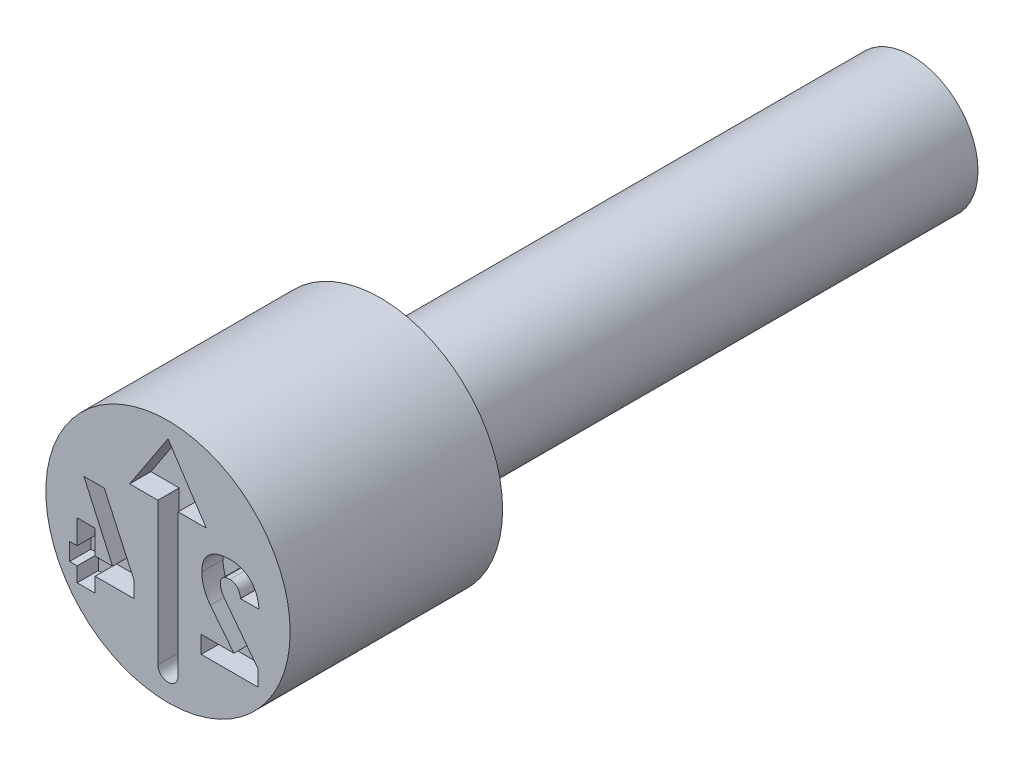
ISO-10303-21;
HEADER;
FILE_DESCRIPTION(('STEP AP214'),'2;1');
FILE_NAME('part.step','',(''),(''),'','','');
FILE_SCHEMA(('AUTOMOTIVE_DESIGN { 1 0 10303 214 1 1 1 1 }'));
ENDSEC;
DATA;
#1=APPLICATION_CONTEXT('core data for automotive mechanical design processes');
#2=APPLICATION_PROTOCOL_DEFINITION('international standard','automotive_design',2000,#1);
#3=PRODUCT_CONTEXT('',#1,'mechanical');
#4=PRODUCT('Part','Part','',(#3));
#5=PRODUCT_RELATED_PRODUCT_CATEGORY('part','',(#4));
#6=PRODUCT_DEFINITION_FORMATION('','',#4);
#7=PRODUCT_DEFINITION_CONTEXT('part definition',#1,'design');
#8=PRODUCT_DEFINITION('design','',#6,#7);
#9=PRODUCT_DEFINITION_SHAPE('','',#8);
#10=(LENGTH_UNIT() NAMED_UNIT(*) SI_UNIT(.MILLI.,.METRE.));
#11=(NAMED_UNIT(*) PLANE_ANGLE_UNIT() SI_UNIT($,.RADIAN.));
#12=(NAMED_UNIT(*) SI_UNIT($,.STERADIAN.) SOLID_ANGLE_UNIT());
#13=UNCERTAINTY_MEASURE_WITH_UNIT(LENGTH_MEASURE(1.E-05),#10,'distance_accuracy_value','');
#14=(GEOMETRIC_REPRESENTATION_CONTEXT(3) GLOBAL_UNCERTAINTY_ASSIGNED_CONTEXT((#13)) GLOBAL_UNIT_ASSIGNED_CONTEXT((#10,
#11,#12)) REPRESENTATION_CONTEXT('',''));
#15=CARTESIAN_POINT('',(0.,0.,0.));
#16=DIRECTION('',(0.,0.,1.));
#17=DIRECTION('',(1.,0.,0.));
#18=AXIS2_PLACEMENT_3D('',#15,#16,#17);
#19=CARTESIAN_POINT('',(0.,1.25,-4.));
#20=DIRECTION('',(0.,0.,1.));
#21=DIRECTION('',(1.,0.,0.));
#22=AXIS2_PLACEMENT_3D('',#19,#20,#21);
#23=PLANE('',#22);
#24=CARTESIAN_POINT('',(0.,0.,-4.));
#25=DIRECTION('',(0.,0.,1.));
#26=DIRECTION('',(1.,0.,0.));
#27=AXIS2_PLACEMENT_3D('',#24,#25,#26);
#28=CIRCLE('',#27,2.3);
#29=CARTESIAN_POINT('',(2.3,0.,-4.));
#30=VERTEX_POINT('',#29);
#31=EDGE_CURVE('E11',#30,#30,#28,.T.);
#32=ORIENTED_EDGE('',*,*,#31,.F.);
#33=EDGE_LOOP('',(#32));
#34=FACE_BOUND('',#33,.T.);
#35=CARTESIAN_POINT('',(0.,0.,-4.));
#36=DIRECTION('',(0.,0.,1.));
#37=DIRECTION('',(1.,0.,0.));
#38=AXIS2_PLACEMENT_3D('',#35,#36,#37);
#39=CIRCLE('',#38,1.25);
#40=CARTESIAN_POINT('',(1.25,0.,-4.));
#41=VERTEX_POINT('',#40);
#42=EDGE_CURVE('E444',#41,#41,#39,.T.);
#43=ORIENTED_EDGE('',*,*,#42,.T.);
#44=EDGE_LOOP('',(#43));
#45=FACE_BOUND('',#44,.T.);
#46=ADVANCED_FACE('F35',(#34,#45),#23,.F.);
#47=CARTESIAN_POINT('',(0.,0.,-0.403888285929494));
#48=DIRECTION('',(0.,0.,1.));
#49=DIRECTION('',(1.,0.,0.));
#50=AXIS2_PLACEMENT_3D('',#47,#48,#49);
#51=CYLINDRICAL_SURFACE('',#50,2.3);
#52=CARTESIAN_POINT('',(0.,0.,0.));
#53=DIRECTION('',(0.,0.,1.));
#54=DIRECTION('',(1.,0.,0.));
#55=AXIS2_PLACEMENT_3D('',#52,#53,#54);
#56=CIRCLE('',#55,2.3);
#57=CARTESIAN_POINT('',(2.3,0.,0.));
#58=VERTEX_POINT('',#57);
#59=EDGE_CURVE('E42',#58,#58,#56,.T.);
#60=ORIENTED_EDGE('',*,*,#59,.F.);
#61=EDGE_LOOP('',(#60));
#62=FACE_BOUND('',#61,.T.);
#63=ORIENTED_EDGE('',*,*,#31,.T.);
#64=EDGE_LOOP('',(#63));
#65=FACE_BOUND('',#64,.T.);
#66=ADVANCED_FACE('F429',(#62,#65),#51,.T.);
#67=CARTESIAN_POINT('',(0.,2.3,0.));
#68=DIRECTION('',(0.,0.,-1.));
#69=DIRECTION('',(-1.,0.,0.));
#70=AXIS2_PLACEMENT_3D('',#67,#68,#69);
#71=PLANE('',#70);
#72=DIRECTION('',(-0.60539313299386,0.795926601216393,0.));
#73=VECTOR('',#72,1.);
#74=CARTESIAN_POINT('',(1.69028245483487,-0.89406969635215,0.));
#75=LINE('',#74,#73);
#76=CARTESIAN_POINT('',(1.69028245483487,-0.89406969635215,0.));
#77=VERTEX_POINT('',#76);
#78=CARTESIAN_POINT('',(1.07255268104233,-0.0819237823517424,0.));
#79=VERTEX_POINT('',#78);
#80=EDGE_CURVE('E709',#77,#79,#75,.T.);
#81=ORIENTED_EDGE('',*,*,#80,.F.);
#82=DIRECTION('',(0.,1.,0.));
#83=VECTOR('',#82,1.);
#84=CARTESIAN_POINT('',(1.69028245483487,-1.2,0.));
#85=LINE('',#84,#83);
#86=CARTESIAN_POINT('',(1.69028245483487,-1.2,0.));
#87=VERTEX_POINT('',#86);
#88=EDGE_CURVE('E49',#87,#77,#85,.T.);
#89=ORIENTED_EDGE('',*,*,#88,.F.);
#90=DIRECTION('',(1.,0.,0.));
#91=VECTOR('',#90,1.);
#92=CARTESIAN_POINT('',(0.625762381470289,-1.2,0.));
#93=LINE('',#92,#91);
#94=CARTESIAN_POINT('',(0.625762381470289,-1.2,0.));
#95=VERTEX_POINT('',#94);
#96=EDGE_CURVE('E308',#95,#87,#93,.T.);
#97=ORIENTED_EDGE('',*,*,#96,.F.);
#98=DIRECTION('',(0.,-1.,0.));
#99=VECTOR('',#98,1.);
#100=CARTESIAN_POINT('',(0.625762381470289,-0.873160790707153,0.));
#101=LINE('',#100,#99);
#102=CARTESIAN_POINT('',(0.625762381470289,-0.873160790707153,0.));
#103=VERTEX_POINT('',#102);
#104=EDGE_CURVE('E311',#103,#95,#101,.T.);
#105=ORIENTED_EDGE('',*,*,#104,.F.);
#106=DIRECTION('',(-1.,0.,0.));
#107=VECTOR('',#106,1.);
#108=CARTESIAN_POINT('',(1.24092439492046,-0.873160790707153,0.));
#109=LINE('',#108,#107);
#110=CARTESIAN_POINT('',(1.24092439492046,-0.873160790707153,0.));
#111=VERTEX_POINT('',#110);
#112=EDGE_CURVE('E643',#111,#103,#109,.T.);
#113=ORIENTED_EDGE('',*,*,#112,.F.);
#114=DIRECTION('',(0.620676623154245,-0.78406666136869,0.));
#115=VECTOR('',#114,1.);
#116=CARTESIAN_POINT('',(0.797802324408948,-0.313389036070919,0.));
#117=LINE('',#116,#115);
#118=CARTESIAN_POINT('',(0.797802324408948,-0.313389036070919,0.));
#119=VERTEX_POINT('',#118);
#120=EDGE_CURVE('E646',#119,#111,#117,.T.);
#121=ORIENTED_EDGE('',*,*,#120,.F.);
#122=CARTESIAN_POINT('',(0.635666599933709,0.148074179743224,0.));
#123=CARTESIAN_POINT('',(0.636136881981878,0.127628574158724,0.));
#124=CARTESIAN_POINT('',(0.637078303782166,0.0867000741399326,0.));
#125=CARTESIAN_POINT('',(0.645474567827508,0.0255541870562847,0.));
#126=CARTESIAN_POINT('',(0.659203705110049,-0.0352384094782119,0.));
#127=CARTESIAN_POINT('',(0.677832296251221,-0.0954646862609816,0.));
#128=CARTESIAN_POINT('',(0.70109424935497,-0.154118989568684,0.));
#129=CARTESIAN_POINT('',(0.728855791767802,-0.210266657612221,0.));
#130=CARTESIAN_POINT('',(0.760551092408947,-0.263764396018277,0.));
#131=CARTESIAN_POINT('',(0.785386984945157,-0.296849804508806,0.));
#132=CARTESIAN_POINT('',(0.797802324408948,-0.313389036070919,0.));
#133=B_SPLINE_CURVE_WITH_KNOTS('',3,(#122,#123,#124,#125,#126,#127,#128,#129,#130,#131,#132),
.UNSPECIFIED.,.F.,.F.,(4,1,1,1,1,1,1,1,4),(0.,0.123148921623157,0.24652244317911,
0.371108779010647,0.498350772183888,0.625999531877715,0.750879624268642,0.875465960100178,1.),.UNSPECIFIED.);
#134=CARTESIAN_POINT('',(0.635666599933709,0.148074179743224,0.));
#135=VERTEX_POINT('',#134);
#136=EDGE_CURVE('E649',#135,#119,#133,.T.);
#137=ORIENTED_EDGE('',*,*,#136,.F.);
#138=DIRECTION('',(0.,-1.,0.));
#139=VECTOR('',#138,1.);
#140=CARTESIAN_POINT('',(0.635666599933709,0.149541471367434,0.));
#141=LINE('',#140,#139);
#142=CARTESIAN_POINT('',(0.635666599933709,0.149541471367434,0.));
#143=VERTEX_POINT('',#142);
#144=EDGE_CURVE('E654',#143,#135,#141,.T.);
#145=ORIENTED_EDGE('',*,*,#144,.F.);
#146=CARTESIAN_POINT('',(1.167926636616,0.618707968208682,0.));
#147=CARTESIAN_POINT('',(1.14087034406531,0.618142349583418,0.));
#148=CARTESIAN_POINT('',(1.08850454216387,0.617047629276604,0.));
#149=CARTESIAN_POINT('',(1.01310130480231,0.60674208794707,0.));
#150=CARTESIAN_POINT('',(0.943766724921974,0.589592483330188,0.));
#151=CARTESIAN_POINT('',(0.880674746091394,0.565497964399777,0.));
#152=CARTESIAN_POINT('',(0.824239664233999,0.53452504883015,0.));
#153=CARTESIAN_POINT('',(0.774200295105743,0.497760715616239,0.));
#154=CARTESIAN_POINT('',(0.731969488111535,0.453777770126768,0.));
#155=CARTESIAN_POINT('',(0.696841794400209,0.403812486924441,0.));
#156=CARTESIAN_POINT('',(0.669150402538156,0.348057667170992,0.));
#157=CARTESIAN_POINT('',(0.649758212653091,0.286561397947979,0.));
#158=CARTESIAN_POINT('',(0.637882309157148,0.219817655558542,0.));
#159=CARTESIAN_POINT('',(0.636419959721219,0.173435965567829,0.));
#160=CARTESIAN_POINT('',(0.635666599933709,0.149541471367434,0.));
#161=B_SPLINE_CURVE_WITH_KNOTS('',3,(#146,#147,#148,#149,#150,#151,#152,#153,#154,#155,#156,
#157,#158,#159,#160),.UNSPECIFIED.,.F.,.F.,(4,1,1,1,1,1,1,1,1,1,1,1,4),(0.,0.100715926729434,
0.194929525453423,0.2827284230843,0.366191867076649,0.44566981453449,0.521804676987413,
0.596515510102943,0.671682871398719,0.748455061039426,0.827368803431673,0.911065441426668,1.),.UNSPECIFIED.);
#162=CARTESIAN_POINT('',(1.167926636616,0.618707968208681,0.));
#163=VERTEX_POINT('',#162);
#164=EDGE_CURVE('E660',#163,#143,#161,.T.);
#165=ORIENTED_EDGE('',*,*,#164,.F.);
#166=CARTESIAN_POINT('',(1.71265865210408,0.080211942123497,0.));
#167=CARTESIAN_POINT('',(1.71016699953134,0.107310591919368,0.));
#168=CARTESIAN_POINT('',(1.70531310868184,0.16010041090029,0.));
#169=CARTESIAN_POINT('',(1.68880850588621,0.236016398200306,0.));
#170=CARTESIAN_POINT('',(1.66442641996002,0.305870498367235,0.));
#171=CARTESIAN_POINT('',(1.63327491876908,0.369855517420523,0.));
#172=CARTESIAN_POINT('',(1.59507774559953,0.427163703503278,0.));
#173=CARTESIAN_POINT('',(1.5507576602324,0.477779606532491,0.));
#174=CARTESIAN_POINT('',(1.49982379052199,0.520720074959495,0.));
#175=CARTESIAN_POINT('',(1.4431583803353,0.556401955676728,0.));
#176=CARTESIAN_POINT('',(1.38100893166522,0.58432664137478,0.));
#177=CARTESIAN_POINT('',(1.31413550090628,0.604672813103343,0.));
#178=CARTESIAN_POINT('',(1.24243736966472,0.616402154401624,0.));
#179=CARTESIAN_POINT('',(1.19315786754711,0.617927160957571,0.));
#180=CARTESIAN_POINT('',(1.167926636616,0.618707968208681,0.));
#181=B_SPLINE_CURVE_WITH_KNOTS('',3,(#166,#167,#168,#169,#170,#171,#172,#173,#174,#175,#176,
#177,#178,#179,#180),.UNSPECIFIED.,.F.,.F.,(4,1,1,1,1,1,1,1,1,1,1,1,4),(0.,0.0953291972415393,
0.185707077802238,0.271513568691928,0.35413169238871,0.434493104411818,0.512233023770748,
0.58917600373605,0.667186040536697,0.746219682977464,0.827302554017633,0.911578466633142,1.),.UNSPECIFIED.);
#182=CARTESIAN_POINT('',(1.71265865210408,0.080211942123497,0.));
#183=VERTEX_POINT('',#182);
#184=EDGE_CURVE('E665',#183,#163,#181,.T.);
#185=ORIENTED_EDGE('',*,*,#184,.F.);
#186=DIRECTION('',(0.,1.,0.));
#187=VECTOR('',#186,1.);
#188=CARTESIAN_POINT('',(1.71265865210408,0.0787446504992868,0.));
#189=LINE('',#188,#187);
#190=CARTESIAN_POINT('',(1.71265865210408,0.0787446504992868,0.));
#191=VERTEX_POINT('',#190);
#192=EDGE_CURVE('E673',#191,#183,#189,.T.);
#193=ORIENTED_EDGE('',*,*,#192,.F.);
#194=DIRECTION('',(1.,0.,0.));
#195=VECTOR('',#194,1.);
#196=CARTESIAN_POINT('',(1.36491053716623,0.0787446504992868,0.));
#197=LINE('',#196,#195);
#198=CARTESIAN_POINT('',(1.36491053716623,0.0787446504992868,0.));
#199=VERTEX_POINT('',#198);
#200=EDGE_CURVE('E679',#199,#191,#197,.T.);
#201=ORIENTED_EDGE('',*,*,#200,.F.);
#202=DIRECTION('',(0.,-1.,0.));
#203=VECTOR('',#202,1.);
#204=CARTESIAN_POINT('',(1.36491053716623,0.080211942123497,0.));
#205=LINE('',#204,#203);
#206=CARTESIAN_POINT('',(1.36491053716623,0.080211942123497,0.));
#207=VERTEX_POINT('',#206);
#208=EDGE_CURVE('E682',#207,#199,#205,.T.);
#209=ORIENTED_EDGE('',*,*,#208,.F.);
#210=CARTESIAN_POINT('',(1.16535887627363,0.291868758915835,0.));
#211=CARTESIAN_POINT('',(1.17875484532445,0.291302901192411,0.));
#212=CARTESIAN_POINT('',(1.20475218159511,0.290204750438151,0.));
#213=CARTESIAN_POINT('',(1.24173358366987,0.279740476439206,0.));
#214=CARTESIAN_POINT('',(1.27458541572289,0.261975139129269,0.));
#215=CARTESIAN_POINT('',(1.30302399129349,0.237423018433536,0.));
#216=CARTESIAN_POINT('',(1.32688653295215,0.206536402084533,0.));
#217=CARTESIAN_POINT('',(1.34447500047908,0.169328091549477,0.));
#218=CARTESIAN_POINT('',(1.35863928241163,0.127039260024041,0.));
#219=CARTESIAN_POINT('',(1.36274973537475,0.0963466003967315,0.));
#220=CARTESIAN_POINT('',(1.36491053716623,0.080211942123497,0.));
#221=B_SPLINE_CURVE_WITH_KNOTS('',3,(#210,#211,#212,#213,#214,#215,#216,#217,#218,#219,#220),
.UNSPECIFIED.,.F.,.F.,(4,1,1,1,1,1,1,1,4),(0.,0.124212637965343,0.241057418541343,
0.353359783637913,0.468536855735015,0.587568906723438,0.713021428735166,0.849139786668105,1.),.UNSPECIFIED.);
#222=CARTESIAN_POINT('',(1.16535887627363,0.291868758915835,0.));
#223=VERTEX_POINT('',#222);
#224=EDGE_CURVE('E685',#223,#207,#221,.T.);
#225=ORIENTED_EDGE('',*,*,#224,.F.);
#226=CARTESIAN_POINT('',(0.984882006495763,0.139637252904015,0.));
#227=CARTESIAN_POINT('',(0.985374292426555,0.151195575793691,0.));
#228=CARTESIAN_POINT('',(0.986312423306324,0.173221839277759,0.));
#229=CARTESIAN_POINT('',(0.995369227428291,0.204210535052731,0.));
#230=CARTESIAN_POINT('',(1.01034559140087,0.231007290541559,0.));
#231=CARTESIAN_POINT('',(1.03132341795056,0.253470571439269,0.));
#232=CARTESIAN_POINT('',(1.05800734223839,0.270734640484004,0.));
#233=CARTESIAN_POINT('',(1.089482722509,0.283345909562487,0.));
#234=CARTESIAN_POINT('',(1.12591682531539,0.290481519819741,0.));
#235=CARTESIAN_POINT('',(1.15175486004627,0.291390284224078,0.));
#236=CARTESIAN_POINT('',(1.16535887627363,0.291868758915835,0.));
#237=B_SPLINE_CURVE_WITH_KNOTS('',3,(#226,#227,#228,#229,#230,#231,#232,#233,#234,#235,#236),
.UNSPECIFIED.,.F.,.F.,(4,1,1,1,1,1,1,1,4),(0.,0.129170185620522,0.246154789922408,
0.35773418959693,0.470108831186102,0.586692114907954,0.710769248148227,0.847716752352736,1.),.UNSPECIFIED.);
#238=CARTESIAN_POINT('',(0.984882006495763,0.139637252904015,0.));
#239=VERTEX_POINT('',#238);
#240=EDGE_CURVE('E690',#239,#223,#237,.T.);
#241=ORIENTED_EDGE('',*,*,#240,.F.);
#242=DIRECTION('',(0.,1.,0.));
#243=VECTOR('',#242,1.);
#244=CARTESIAN_POINT('',(0.984882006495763,0.137069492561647,0.));
#245=LINE('',#244,#243);
#246=CARTESIAN_POINT('',(0.984882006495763,0.137069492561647,0.));
#247=VERTEX_POINT('',#246);
#248=EDGE_CURVE('E698',#247,#239,#245,.T.);
#249=ORIENTED_EDGE('',*,*,#248,.F.);
#250=CARTESIAN_POINT('',(1.07255268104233,-0.0819237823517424,0.));
#251=CARTESIAN_POINT('',(1.0595972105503,-0.0639492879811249,0.));
#252=CARTESIAN_POINT('',(1.03430543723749,-0.0288593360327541,0.));
#253=CARTESIAN_POINT('',(1.01167711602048,0.0195395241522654,0.));
#254=CARTESIAN_POINT('',(0.997302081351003,0.0574892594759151,0.));
#255=CARTESIAN_POINT('',(0.990656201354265,0.0850173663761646,0.));
#256=CARTESIAN_POINT('',(0.98573641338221,0.111340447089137,0.));
#257=CARTESIAN_POINT('',(0.985162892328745,0.128611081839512,0.));
#258=CARTESIAN_POINT('',(0.984882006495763,0.137069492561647,0.));
#259=B_SPLINE_CURVE_WITH_KNOTS('',3,(#250,#251,#252,#253,#254,#255,#256,#257,#258),
.UNSPECIFIED.,.F.,.F.,(4,1,1,1,1,1,4),(0.,0.27673722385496,0.540248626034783,0.66563356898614,
0.784034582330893,0.894229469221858,1.),.UNSPECIFIED.);
#260=EDGE_CURVE('E704',#79,#247,#259,.T.);
#261=ORIENTED_EDGE('',*,*,#260,.F.);
#262=EDGE_LOOP('',(#81,#89,#97,#105,#113,#121,#137,#145,#165,#185,#193,#201,#209,#225,#241,#249,#261));
#263=FACE_BOUND('',#262,.T.);
#264=DIRECTION('',(0.,-1.,0.));
#265=VECTOR('',#264,1.);
#266=CARTESIAN_POINT('',(-1.71054738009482,-0.14134909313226,0.));
#267=LINE('',#266,#265);
#268=CARTESIAN_POINT('',(-1.71054738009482,-0.14134909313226,0.));
#269=VERTEX_POINT('',#268);
#270=CARTESIAN_POINT('',(-1.71054738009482,-0.596943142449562,0.));
#271=VERTEX_POINT('',#270);
#272=EDGE_CURVE('E592',#269,#271,#267,.T.);
#273=ORIENTED_EDGE('',*,*,#272,.F.);
#274=DIRECTION('',(-1.,0.,0.));
#275=VECTOR('',#274,1.);
#276=CARTESIAN_POINT('',(-1.37123619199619,-0.14134909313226,0.));
#277=LINE('',#276,#275);
#278=CARTESIAN_POINT('',(-1.37123619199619,-0.14134909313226,0.));
#279=VERTEX_POINT('',#278);
#280=EDGE_CURVE('E595',#279,#269,#277,.T.);
#281=ORIENTED_EDGE('',*,*,#280,.F.);
#282=DIRECTION('',(0.,1.,0.));
#283=VECTOR('',#282,1.);
#284=CARTESIAN_POINT('',(-1.37123619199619,-1.20110046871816,0.));
#285=LINE('',#284,#283);
#286=CARTESIAN_POINT('',(-1.37123619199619,-0.596943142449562,0.));
#287=VERTEX_POINT('',#286);
#288=EDGE_CURVE('E600',#287,#279,#285,.T.);
#289=ORIENTED_EDGE('',*,*,#288,.F.);
#290=DIRECTION('',(-1.,0.,0.));
#291=VECTOR('',#290,1.);
#292=CARTESIAN_POINT('',(-1.04329651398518,-0.596943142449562,0.));
#293=LINE('',#292,#291);
#294=CARTESIAN_POINT('',(-1.04329651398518,-0.596943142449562,0.));
#295=VERTEX_POINT('',#294);
#296=EDGE_CURVE('E533',#295,#287,#293,.T.);
#297=ORIENTED_EDGE('',*,*,#296,.F.);
#298=DIRECTION('',(0.411526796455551,-0.911397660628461,0.));
#299=VECTOR('',#298,1.);
#300=CARTESIAN_POINT('',(-1.58325983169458,0.598899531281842,0.));
#301=LINE('',#300,#299);
#302=CARTESIAN_POINT('',(-1.58325983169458,0.598899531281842,0.));
#303=VERTEX_POINT('',#302);
#304=EDGE_CURVE('E537',#303,#295,#301,.T.);
#305=ORIENTED_EDGE('',*,*,#304,.F.);
#306=DIRECTION('',(-1.,0.,0.));
#307=VECTOR('',#306,1.);
#308=CARTESIAN_POINT('',(-1.19919624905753,0.598899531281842,0.));
#309=LINE('',#308,#307);
#310=CARTESIAN_POINT('',(-1.19919624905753,0.598899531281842,0.));
#311=VERTEX_POINT('',#310);
#312=EDGE_CURVE('E540',#311,#303,#309,.T.);
#313=ORIENTED_EDGE('',*,*,#312,.F.);
#314=DIRECTION('',(-0.416436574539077,0.909164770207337,0.));
#315=VECTOR('',#314,1.);
#316=CARTESIAN_POINT('',(-0.644560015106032,-0.611982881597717,0.));
#317=LINE('',#316,#315);
#318=CARTESIAN_POINT('',(-0.644560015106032,-0.611982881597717,0.));
#319=VERTEX_POINT('',#318);
#320=EDGE_CURVE('E543',#319,#311,#317,.T.);
#321=ORIENTED_EDGE('',*,*,#320,.F.);
#322=DIRECTION('',(0.,1.,0.));
#323=VECTOR('',#322,1.);
#324=CARTESIAN_POINT('',(-0.644560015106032,-0.923782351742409,0.));
#325=LINE('',#324,#323);
#326=CARTESIAN_POINT('',(-0.644560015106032,-0.923782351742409,0.));
#327=VERTEX_POINT('',#326);
#328=EDGE_CURVE('E546',#327,#319,#325,.T.);
#329=ORIENTED_EDGE('',*,*,#328,.F.);
#330=DIRECTION('',(1.,0.,0.));
#331=VECTOR('',#330,1.);
#332=CARTESIAN_POINT('',(-1.85177419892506,-0.923782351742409,0.));
#333=LINE('',#332,#331);
#334=CARTESIAN_POINT('',(-1.37123619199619,-0.923782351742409,0.));
#335=VERTEX_POINT('',#334);
#336=EDGE_CURVE('E529',#335,#327,#333,.T.);
#337=ORIENTED_EDGE('',*,*,#336,.F.);
#338=CARTESIAN_POINT('',(-1.37123619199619,-1.20110046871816,0.));
#339=VERTEX_POINT('',#338);
#340=EDGE_CURVE('E598',#339,#335,#285,.T.);
#341=ORIENTED_EDGE('',*,*,#340,.F.);
#342=DIRECTION('',(1.,0.,0.));
#343=VECTOR('',#342,1.);
#344=CARTESIAN_POINT('',(-1.71054738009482,-1.20110046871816,0.));
#345=LINE('',#344,#343);
#346=CARTESIAN_POINT('',(-1.71054738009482,-1.20110046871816,0.));
#347=VERTEX_POINT('',#346);
#348=EDGE_CURVE('E589',#347,#339,#345,.T.);
#349=ORIENTED_EDGE('',*,*,#348,.F.);
#350=CARTESIAN_POINT('',(-1.71054738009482,-0.923782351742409,0.));
#351=VERTEX_POINT('',#350);
#352=EDGE_CURVE('E594',#351,#347,#267,.T.);
#353=ORIENTED_EDGE('',*,*,#352,.F.);
#354=CARTESIAN_POINT('',(-1.85177419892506,-0.923782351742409,0.));
#355=VERTEX_POINT('',#354);
#356=EDGE_CURVE('E525',#355,#351,#333,.T.);
#357=ORIENTED_EDGE('',*,*,#356,.F.);
#358=DIRECTION('',(0.,-1.,0.));
#359=VECTOR('',#358,1.);
#360=CARTESIAN_POINT('',(-1.85177419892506,-0.596943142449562,0.));
#361=LINE('',#360,#359);
#362=CARTESIAN_POINT('',(-1.85177419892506,-0.596943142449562,0.));
#363=VERTEX_POINT('',#362);
#364=EDGE_CURVE('E530',#363,#355,#361,.T.);
#365=ORIENTED_EDGE('',*,*,#364,.F.);
#366=EDGE_CURVE('E536',#271,#363,#293,.T.);
#367=ORIENTED_EDGE('',*,*,#366,.F.);
#368=EDGE_LOOP('',(#273,#281,#289,#297,#305,#313,#321,#329,#337,#341,#349,#353,#357,#365,#367));
#369=FACE_BOUND('',#368,.T.);
#370=DIRECTION('',(0.,1.,0.));
#371=VECTOR('',#370,1.);
#372=CARTESIAN_POINT('',(0.190473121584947,0.906351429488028,0.));
#373=LINE('',#372,#371);
#374=CARTESIAN_POINT('',(0.190473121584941,-1.77616183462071,0.));
#375=VERTEX_POINT('',#374);
#376=CARTESIAN_POINT('',(0.190473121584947,0.906351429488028,0.));
#377=VERTEX_POINT('',#376);
#378=EDGE_CURVE('E483',#375,#377,#373,.T.);
#379=ORIENTED_EDGE('',*,*,#378,.F.);
#380=CARTESIAN_POINT('',(1.6342449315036E-13,-1.77616183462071,0.));
#381=DIRECTION('',(0.,0.,1.));
#382=DIRECTION('',(1.,0.,0.));
#383=AXIS2_PLACEMENT_3D('',#380,#381,#382);
#384=CIRCLE('',#383,0.190473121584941);
#385=CARTESIAN_POINT('',(-0.190473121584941,-1.77616183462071,0.));
#386=VERTEX_POINT('',#385);
#387=EDGE_CURVE('E486',#386,#375,#384,.T.);
#388=ORIENTED_EDGE('',*,*,#387,.F.);
#389=DIRECTION('',(0.,-1.,0.));
#390=VECTOR('',#389,1.);
#391=CARTESIAN_POINT('',(-0.190473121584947,0.906351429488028,0.));
#392=LINE('',#391,#390);
#393=CARTESIAN_POINT('',(-0.190473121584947,0.906351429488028,0.));
#394=VERTEX_POINT('',#393);
#395=EDGE_CURVE('E467',#394,#386,#392,.T.);
#396=ORIENTED_EDGE('',*,*,#395,.F.);
#397=DIRECTION('',(1.,0.,0.));
#398=VECTOR('',#397,1.);
#399=CARTESIAN_POINT('',(-0.721917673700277,0.906351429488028,0.));
#400=LINE('',#399,#398);
#401=CARTESIAN_POINT('',(-0.721917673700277,0.906351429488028,0.));
#402=VERTEX_POINT('',#401);
#403=EDGE_CURVE('E471',#402,#394,#400,.T.);
#404=ORIENTED_EDGE('',*,*,#403,.F.);
#405=DIRECTION('',(-0.550159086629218,-0.835059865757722,0.));
#406=VECTOR('',#405,1.);
#407=CARTESIAN_POINT('',(0.,2.00211534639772,0.));
#408=LINE('',#407,#406);
#409=CARTESIAN_POINT('',(0.,2.00211534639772,0.));
#410=VERTEX_POINT('',#409);
#411=EDGE_CURVE('E474',#410,#402,#408,.T.);
#412=ORIENTED_EDGE('',*,*,#411,.F.);
#413=DIRECTION('',(-0.550159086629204,0.835059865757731,0.));
#414=VECTOR('',#413,1.);
#415=CARTESIAN_POINT('',(0.,2.00211534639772,0.));
#416=LINE('',#415,#414);
#417=CARTESIAN_POINT('',(0.721917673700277,0.906351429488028,0.));
#418=VERTEX_POINT('',#417);
#419=EDGE_CURVE('E477',#418,#410,#416,.T.);
#420=ORIENTED_EDGE('',*,*,#419,.F.);
#421=DIRECTION('',(1.,0.,0.));
#422=VECTOR('',#421,1.);
#423=CARTESIAN_POINT('',(0.721917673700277,0.906351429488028,0.));
#424=LINE('',#423,#422);
#425=EDGE_CURVE('E480',#377,#418,#424,.T.);
#426=ORIENTED_EDGE('',*,*,#425,.F.);
#427=EDGE_LOOP('',(#379,#388,#396,#404,#412,#420,#426));
#428=FACE_BOUND('',#427,.T.);
#429=ORIENTED_EDGE('',*,*,#59,.T.);
#430=EDGE_LOOP('',(#429));
#431=FACE_BOUND('',#430,.T.);
#432=ADVANCED_FACE('F426',(#263,#369,#428,#431),#71,.F.);
#433=CARTESIAN_POINT('',(0.,0.,-14.));
#434=DIRECTION('',(0.,0.,1.));
#435=DIRECTION('',(1.,0.,0.));
#436=AXIS2_PLACEMENT_3D('',#433,#434,#435);
#437=PLANE('',#436);
#438=CARTESIAN_POINT('',(0.,0.,-14.));
#439=DIRECTION('',(0.,0.,1.));
#440=DIRECTION('',(1.,0.,0.));
#441=AXIS2_PLACEMENT_3D('',#438,#439,#440);
#442=CIRCLE('',#441,1.25);
#443=CARTESIAN_POINT('',(1.25,0.,-14.));
#444=VERTEX_POINT('',#443);
#445=EDGE_CURVE('E445',#444,#444,#442,.T.);
#446=ORIENTED_EDGE('',*,*,#445,.F.);
#447=EDGE_LOOP('',(#446));
#448=FACE_BOUND('',#447,.T.);
#449=ADVANCED_FACE('F422',(#448),#437,.F.);
#450=CARTESIAN_POINT('',(0.,0.,-0.403888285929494));
#451=DIRECTION('',(0.,0.,1.));
#452=DIRECTION('',(1.,0.,0.));
#453=AXIS2_PLACEMENT_3D('',#450,#451,#452);
#454=CYLINDRICAL_SURFACE('',#453,1.25);
#455=ORIENTED_EDGE('',*,*,#42,.F.);
#456=EDGE_LOOP('',(#455));
#457=FACE_BOUND('',#456,.T.);
#458=ORIENTED_EDGE('',*,*,#445,.T.);
#459=EDGE_LOOP('',(#458));
#460=FACE_BOUND('',#459,.T.);
#461=ADVANCED_FACE('F418',(#457,#460),#454,.T.);
#462=CARTESIAN_POINT('',(1.6342449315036E-13,-1.77616183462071,-0.4));
#463=DIRECTION('',(0.,0.,1.));
#464=DIRECTION('',(1.,0.,0.));
#465=AXIS2_PLACEMENT_3D('',#462,#463,#464);
#466=CYLINDRICAL_SURFACE('',#465,0.190473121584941);
#467=ORIENTED_EDGE('',*,*,#387,.T.);
#468=DIRECTION('',(0.,0.,1.));
#469=VECTOR('',#468,1.);
#470=CARTESIAN_POINT('',(0.190473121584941,-1.77616183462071,-0.4));
#471=LINE('',#470,#469);
#472=CARTESIAN_POINT('',(0.190473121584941,-1.77616183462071,-0.4));
#473=VERTEX_POINT('',#472);
#474=EDGE_CURVE('E453',#473,#375,#471,.T.);
#475=ORIENTED_EDGE('',*,*,#474,.F.);
#476=CARTESIAN_POINT('',(1.6342449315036E-13,-1.77616183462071,-0.4));
#477=DIRECTION('',(0.,0.,1.));
#478=DIRECTION('',(1.,0.,0.));
#479=AXIS2_PLACEMENT_3D('',#476,#477,#478);
#480=CIRCLE('',#479,0.190473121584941);
#481=CARTESIAN_POINT('',(-0.190473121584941,-1.77616183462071,-0.4));
#482=VERTEX_POINT('',#481);
#483=EDGE_CURVE('E470',#482,#473,#480,.T.);
#484=ORIENTED_EDGE('',*,*,#483,.F.);
#485=DIRECTION('',(0.,0.,1.));
#486=VECTOR('',#485,1.);
#487=CARTESIAN_POINT('',(-0.190473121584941,-1.77616183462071,-0.4));
#488=LINE('',#487,#486);
#489=EDGE_CURVE('E446',#482,#386,#488,.T.);
#490=ORIENTED_EDGE('',*,*,#489,.T.);
#491=EDGE_LOOP('',(#467,#475,#484,#490));
#492=FACE_BOUND('',#491,.T.);
#493=ADVANCED_FACE('F396',(#492),#466,.F.);
#494=CARTESIAN_POINT('',(-0.190473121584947,0.906351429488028,-0.4));
#495=DIRECTION('',(-1.,0.,0.));
#496=DIRECTION('',(0.,-1.,0.));
#497=AXIS2_PLACEMENT_3D('',#494,#495,#496);
#498=PLANE('',#497);
#499=ORIENTED_EDGE('',*,*,#395,.T.);
#500=ORIENTED_EDGE('',*,*,#489,.F.);
#501=DIRECTION('',(0.,-1.,0.));
#502=VECTOR('',#501,1.);
#503=CARTESIAN_POINT('',(-0.190473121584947,0.906351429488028,-0.4));
#504=LINE('',#503,#502);
#505=CARTESIAN_POINT('',(-0.190473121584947,0.906351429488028,-0.4));
#506=VERTEX_POINT('',#505);
#507=EDGE_CURVE('E458',#506,#482,#504,.T.);
#508=ORIENTED_EDGE('',*,*,#507,.F.);
#509=DIRECTION('',(0.,0.,1.));
#510=VECTOR('',#509,1.);
#511=CARTESIAN_POINT('',(-0.190473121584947,0.906351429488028,-0.4));
#512=LINE('',#511,#510);
#513=EDGE_CURVE('E450',#506,#394,#512,.T.);
#514=ORIENTED_EDGE('',*,*,#513,.T.);
#515=EDGE_LOOP('',(#499,#500,#508,#514));
#516=FACE_BOUND('',#515,.T.);
#517=ADVANCED_FACE('F392',(#516),#498,.F.);
#518=CARTESIAN_POINT('',(-0.721917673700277,0.906351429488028,-0.4));
#519=DIRECTION('',(0.,-1.,0.));
#520=DIRECTION('',(0.,0.,-1.));
#521=AXIS2_PLACEMENT_3D('',#518,#519,#520);
#522=PLANE('',#521);
#523=ORIENTED_EDGE('',*,*,#403,.T.);
#524=ORIENTED_EDGE('',*,*,#513,.F.);
#525=DIRECTION('',(1.,0.,0.));
#526=VECTOR('',#525,1.);
#527=CARTESIAN_POINT('',(-0.721917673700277,0.906351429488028,-0.4));
#528=LINE('',#527,#526);
#529=CARTESIAN_POINT('',(-0.721917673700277,0.906351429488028,-0.4));
#530=VERTEX_POINT('',#529);
#531=EDGE_CURVE('E491',#530,#506,#528,.T.);
#532=ORIENTED_EDGE('',*,*,#531,.F.);
#533=DIRECTION('',(0.,0.,1.));
#534=VECTOR('',#533,1.);
#535=CARTESIAN_POINT('',(-0.721917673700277,0.906351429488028,-0.4));
#536=LINE('',#535,#534);
#537=EDGE_CURVE('E464',#530,#402,#536,.T.);
#538=ORIENTED_EDGE('',*,*,#537,.T.);
#539=EDGE_LOOP('',(#523,#524,#532,#538));
#540=FACE_BOUND('',#539,.T.);
#541=ADVANCED_FACE('F395',(#540),#522,.F.);
#542=CARTESIAN_POINT('',(0.,2.00211534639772,-0.4));
#543=DIRECTION('',(-0.835059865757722,0.550159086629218,0.));
#544=DIRECTION('',(-0.550159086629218,-0.835059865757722,0.));
#545=AXIS2_PLACEMENT_3D('',#542,#543,#544);
#546=PLANE('',#545);
#547=ORIENTED_EDGE('',*,*,#411,.T.);
#548=ORIENTED_EDGE('',*,*,#537,.F.);
#549=DIRECTION('',(-0.550159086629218,-0.835059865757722,0.));
#550=VECTOR('',#549,1.);
#551=CARTESIAN_POINT('',(0.,2.00211534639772,-0.4));
#552=LINE('',#551,#550);
#553=CARTESIAN_POINT('',(0.,2.00211534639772,-0.4));
#554=VERTEX_POINT('',#553);
#555=EDGE_CURVE('E494',#554,#530,#552,.T.);
#556=ORIENTED_EDGE('',*,*,#555,.F.);
#557=DIRECTION('',(0.,0.,1.));
#558=VECTOR('',#557,1.);
#559=CARTESIAN_POINT('',(0.,2.00211534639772,-0.4));
#560=LINE('',#559,#558);
#561=EDGE_CURVE('E462',#554,#410,#560,.T.);
#562=ORIENTED_EDGE('',*,*,#561,.T.);
#563=EDGE_LOOP('',(#547,#548,#556,#562));
#564=FACE_BOUND('',#563,.T.);
#565=ADVANCED_FACE('F400',(#564),#546,.F.);
#566=CARTESIAN_POINT('',(0.,2.00211534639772,-0.4));
#567=DIRECTION('',(0.835059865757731,0.550159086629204,0.));
#568=DIRECTION('',(-0.550159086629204,0.835059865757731,0.));
#569=AXIS2_PLACEMENT_3D('',#566,#567,#568);
#570=PLANE('',#569);
#571=ORIENTED_EDGE('',*,*,#419,.T.);
#572=ORIENTED_EDGE('',*,*,#561,.F.);
#573=DIRECTION('',(-0.550159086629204,0.835059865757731,0.));
#574=VECTOR('',#573,1.);
#575=CARTESIAN_POINT('',(0.,2.00211534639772,-0.4));
#576=LINE('',#575,#574);
#577=CARTESIAN_POINT('',(0.721917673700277,0.906351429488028,-0.4));
#578=VERTEX_POINT('',#577);
#579=EDGE_CURVE('E497',#578,#554,#576,.T.);
#580=ORIENTED_EDGE('',*,*,#579,.F.);
#581=DIRECTION('',(0.,0.,1.));
#582=VECTOR('',#581,1.);
#583=CARTESIAN_POINT('',(0.721917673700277,0.906351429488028,-0.4));
#584=LINE('',#583,#582);
#585=EDGE_CURVE('E460',#578,#418,#584,.T.);
#586=ORIENTED_EDGE('',*,*,#585,.T.);
#587=EDGE_LOOP('',(#571,#572,#580,#586));
#588=FACE_BOUND('',#587,.T.);
#589=ADVANCED_FACE('F404',(#588),#570,.F.);
#590=CARTESIAN_POINT('',(0.721917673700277,0.906351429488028,-0.4));
#591=DIRECTION('',(0.,-1.,0.));
#592=DIRECTION('',(0.,0.,-1.));
#593=AXIS2_PLACEMENT_3D('',#590,#591,#592);
#594=PLANE('',#593);
#595=ORIENTED_EDGE('',*,*,#425,.T.);
#596=ORIENTED_EDGE('',*,*,#585,.F.);
#597=DIRECTION('',(1.,0.,0.));
#598=VECTOR('',#597,1.);
#599=CARTESIAN_POINT('',(0.721917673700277,0.906351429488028,-0.4));
#600=LINE('',#599,#598);
#601=CARTESIAN_POINT('',(0.190473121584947,0.906351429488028,-0.4));
#602=VERTEX_POINT('',#601);
#603=EDGE_CURVE('E500',#602,#578,#600,.T.);
#604=ORIENTED_EDGE('',*,*,#603,.F.);
#605=DIRECTION('',(0.,0.,1.));
#606=VECTOR('',#605,1.);
#607=CARTESIAN_POINT('',(0.190473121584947,0.906351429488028,-0.4));
#608=LINE('',#607,#606);
#609=EDGE_CURVE('E457',#602,#377,#608,.T.);
#610=ORIENTED_EDGE('',*,*,#609,.T.);
#611=EDGE_LOOP('',(#595,#596,#604,#610));
#612=FACE_BOUND('',#611,.T.);
#613=ADVANCED_FACE('F408',(#612),#594,.F.);
#614=CARTESIAN_POINT('',(0.190473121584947,0.906351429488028,-0.4));
#615=DIRECTION('',(1.,0.,0.));
#616=DIRECTION('',(0.,1.,0.));
#617=AXIS2_PLACEMENT_3D('',#614,#615,#616);
#618=PLANE('',#617);
#619=ORIENTED_EDGE('',*,*,#378,.T.);
#620=ORIENTED_EDGE('',*,*,#609,.F.);
#621=DIRECTION('',(0.,1.,0.));
#622=VECTOR('',#621,1.);
#623=CARTESIAN_POINT('',(0.190473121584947,0.906351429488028,-0.4));
#624=LINE('',#623,#622);
#625=EDGE_CURVE('E503',#473,#602,#624,.T.);
#626=ORIENTED_EDGE('',*,*,#625,.F.);
#627=ORIENTED_EDGE('',*,*,#474,.T.);
#628=EDGE_LOOP('',(#619,#620,#626,#627));
#629=FACE_BOUND('',#628,.T.);
#630=ADVANCED_FACE('F390',(#629),#618,.F.);
#631=CARTESIAN_POINT('',(1.6342449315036E-13,-1.77616183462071,-0.4));
#632=DIRECTION('',(0.,0.,1.));
#633=DIRECTION('',(1.,0.,0.));
#634=AXIS2_PLACEMENT_3D('',#631,#632,#633);
#635=PLANE('',#634);
#636=ORIENTED_EDGE('',*,*,#483,.T.);
#637=ORIENTED_EDGE('',*,*,#625,.T.);
#638=ORIENTED_EDGE('',*,*,#603,.T.);
#639=ORIENTED_EDGE('',*,*,#579,.T.);
#640=ORIENTED_EDGE('',*,*,#555,.T.);
#641=ORIENTED_EDGE('',*,*,#531,.T.);
#642=ORIENTED_EDGE('',*,*,#507,.T.);
#643=EDGE_LOOP('',(#636,#637,#638,#639,#640,#641,#642));
#644=FACE_BOUND('',#643,.T.);
#645=ADVANCED_FACE('F387',(#644),#635,.T.);
#646=CARTESIAN_POINT('',(-1.85177419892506,-0.923782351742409,-0.4));
#647=DIRECTION('',(0.,-1.,0.));
#648=DIRECTION('',(0.,0.,-1.));
#649=AXIS2_PLACEMENT_3D('',#646,#647,#648);
#650=PLANE('',#649);
#651=DIRECTION('',(0.,0.,1.));
#652=VECTOR('',#651,1.);
#653=CARTESIAN_POINT('',(-1.37123619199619,-0.923782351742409,-0.4));
#654=LINE('',#653,#652);
#655=CARTESIAN_POINT('',(-1.37123619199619,-0.923782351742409,-0.4));
#656=VERTEX_POINT('',#655);
#657=EDGE_CURVE('E549',#656,#335,#654,.T.);
#658=ORIENTED_EDGE('',*,*,#657,.T.);
#659=ORIENTED_EDGE('',*,*,#336,.T.);
#660=DIRECTION('',(0.,0.,1.));
#661=VECTOR('',#660,1.);
#662=CARTESIAN_POINT('',(-0.644560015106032,-0.923782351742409,-0.4));
#663=LINE('',#662,#661);
#664=CARTESIAN_POINT('',(-0.644560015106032,-0.923782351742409,-0.4));
#665=VERTEX_POINT('',#664);
#666=EDGE_CURVE('E522',#665,#327,#663,.T.);
#667=ORIENTED_EDGE('',*,*,#666,.F.);
#668=DIRECTION('',(1.,0.,0.));
#669=VECTOR('',#668,1.);
#670=CARTESIAN_POINT('',(-1.85177419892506,-0.923782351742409,-0.4));
#671=LINE('',#670,#669);
#672=EDGE_CURVE('E552',#656,#665,#671,.T.);
#673=ORIENTED_EDGE('',*,*,#672,.F.);
#674=EDGE_LOOP('',(#658,#659,#667,#673));
#675=FACE_BOUND('',#674,.T.);
#676=ADVANCED_FACE('F364',(#675),#650,.F.);
#677=CARTESIAN_POINT('',(-1.04329651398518,-0.596943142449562,-0.4));
#678=DIRECTION('',(0.,1.,0.));
#679=DIRECTION('',(0.,0.,1.));
#680=AXIS2_PLACEMENT_3D('',#677,#678,#679);
#681=PLANE('',#680);
#682=DIRECTION('',(0.,0.,-1.));
#683=VECTOR('',#682,1.);
#684=CARTESIAN_POINT('',(-1.37123619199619,-0.596943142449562,-0.4));
#685=LINE('',#684,#683);
#686=CARTESIAN_POINT('',(-1.37123619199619,-0.596943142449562,-0.4));
#687=VERTEX_POINT('',#686);
#688=EDGE_CURVE('E573',#287,#687,#685,.T.);
#689=ORIENTED_EDGE('',*,*,#688,.T.);
#690=DIRECTION('',(-1.,0.,0.));
#691=VECTOR('',#690,1.);
#692=CARTESIAN_POINT('',(-1.04329651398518,-0.596943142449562,-0.4));
#693=LINE('',#692,#691);
#694=CARTESIAN_POINT('',(-1.04329651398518,-0.596943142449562,-0.4));
#695=VERTEX_POINT('',#694);
#696=EDGE_CURVE('E556',#695,#687,#693,.T.);
#697=ORIENTED_EDGE('',*,*,#696,.F.);
#698=DIRECTION('',(0.,0.,1.));
#699=VECTOR('',#698,1.);
#700=CARTESIAN_POINT('',(-1.04329651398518,-0.596943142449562,-0.4));
#701=LINE('',#700,#699);
#702=EDGE_CURVE('E515',#695,#295,#701,.T.);
#703=ORIENTED_EDGE('',*,*,#702,.T.);
#704=ORIENTED_EDGE('',*,*,#296,.T.);
#705=EDGE_LOOP('',(#689,#697,#703,#704));
#706=FACE_BOUND('',#705,.T.);
#707=ADVANCED_FACE('F373',(#706),#681,.F.);
#708=CARTESIAN_POINT('',(-0.644560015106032,-0.923782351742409,-0.4));
#709=DIRECTION('',(1.,0.,0.));
#710=DIRECTION('',(0.,0.,-1.));
#711=AXIS2_PLACEMENT_3D('',#708,#709,#710);
#712=PLANE('',#711);
#713=ORIENTED_EDGE('',*,*,#328,.T.);
#714=DIRECTION('',(0.,0.,1.));
#715=VECTOR('',#714,1.);
#716=CARTESIAN_POINT('',(-0.644560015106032,-0.611982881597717,-0.4));
#717=LINE('',#716,#715);
#718=CARTESIAN_POINT('',(-0.644560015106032,-0.611982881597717,-0.4));
#719=VERTEX_POINT('',#718);
#720=EDGE_CURVE('E508',#719,#319,#717,.T.);
#721=ORIENTED_EDGE('',*,*,#720,.F.);
#722=DIRECTION('',(0.,1.,0.));
#723=VECTOR('',#722,1.);
#724=CARTESIAN_POINT('',(-0.644560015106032,-0.923782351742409,-0.4));
#725=LINE('',#724,#723);
#726=EDGE_CURVE('E528',#665,#719,#725,.T.);
#727=ORIENTED_EDGE('',*,*,#726,.F.);
#728=ORIENTED_EDGE('',*,*,#666,.T.);
#729=EDGE_LOOP('',(#713,#721,#727,#728));
#730=FACE_BOUND('',#729,.T.);
#731=ADVANCED_FACE('F362',(#730),#712,.F.);
#732=DIRECTION('',(0.,0.,-1.));
#733=VECTOR('',#732,1.);
#734=CARTESIAN_POINT('',(-1.71054738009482,-0.923782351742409,-0.4));
#735=LINE('',#734,#733);
#736=CARTESIAN_POINT('',(-1.71054738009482,-0.923782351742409,-0.4));
#737=VERTEX_POINT('',#736);
#738=EDGE_CURVE('E575',#351,#737,#735,.T.);
#739=ORIENTED_EDGE('',*,*,#738,.T.);
#740=CARTESIAN_POINT('',(-1.85177419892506,-0.923782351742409,-0.4));
#741=VERTEX_POINT('',#740);
#742=EDGE_CURVE('E511',#741,#737,#671,.T.);
#743=ORIENTED_EDGE('',*,*,#742,.F.);
#744=DIRECTION('',(0.,0.,1.));
#745=VECTOR('',#744,1.);
#746=CARTESIAN_POINT('',(-1.85177419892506,-0.923782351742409,-0.4));
#747=LINE('',#746,#745);
#748=EDGE_CURVE('E520',#741,#355,#747,.T.);
#749=ORIENTED_EDGE('',*,*,#748,.T.);
#750=ORIENTED_EDGE('',*,*,#356,.T.);
#751=EDGE_LOOP('',(#739,#743,#749,#750));
#752=FACE_BOUND('',#751,.T.);
#753=ADVANCED_FACE('F358',(#752),#650,.F.);
#754=CARTESIAN_POINT('',(-1.85177419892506,-0.596943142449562,-0.4));
#755=DIRECTION('',(-1.,0.,0.));
#756=DIRECTION('',(0.,0.,1.));
#757=AXIS2_PLACEMENT_3D('',#754,#755,#756);
#758=PLANE('',#757);
#759=ORIENTED_EDGE('',*,*,#364,.T.);
#760=ORIENTED_EDGE('',*,*,#748,.F.);
#761=DIRECTION('',(0.,-1.,0.));
#762=VECTOR('',#761,1.);
#763=CARTESIAN_POINT('',(-1.85177419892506,-0.596943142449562,-0.4));
#764=LINE('',#763,#762);
#765=CARTESIAN_POINT('',(-1.85177419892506,-0.596943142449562,-0.4));
#766=VERTEX_POINT('',#765);
#767=EDGE_CURVE('E553',#766,#741,#764,.T.);
#768=ORIENTED_EDGE('',*,*,#767,.F.);
#769=DIRECTION('',(0.,0.,1.));
#770=VECTOR('',#769,1.);
#771=CARTESIAN_POINT('',(-1.85177419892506,-0.596943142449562,-0.4));
#772=LINE('',#771,#770);
#773=EDGE_CURVE('E517',#766,#363,#772,.T.);
#774=ORIENTED_EDGE('',*,*,#773,.T.);
#775=EDGE_LOOP('',(#759,#760,#768,#774));
#776=FACE_BOUND('',#775,.T.);
#777=ADVANCED_FACE('F361',(#776),#758,.F.);
#778=DIRECTION('',(0.,0.,1.));
#779=VECTOR('',#778,1.);
#780=CARTESIAN_POINT('',(-1.71054738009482,-0.596943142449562,-0.4));
#781=LINE('',#780,#779);
#782=CARTESIAN_POINT('',(-1.71054738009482,-0.596943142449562,-0.4));
#783=VERTEX_POINT('',#782);
#784=EDGE_CURVE('E577',#783,#271,#781,.T.);
#785=ORIENTED_EDGE('',*,*,#784,.T.);
#786=ORIENTED_EDGE('',*,*,#366,.T.);
#787=ORIENTED_EDGE('',*,*,#773,.F.);
#788=EDGE_CURVE('E559',#783,#766,#693,.T.);
#789=ORIENTED_EDGE('',*,*,#788,.F.);
#790=EDGE_LOOP('',(#785,#786,#787,#789));
#791=FACE_BOUND('',#790,.T.);
#792=ADVANCED_FACE('F367',(#791),#681,.F.);
#793=CARTESIAN_POINT('',(-1.58325983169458,0.598899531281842,-0.4));
#794=DIRECTION('',(-0.911397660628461,-0.411526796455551,0.));
#795=DIRECTION('',(0.411526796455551,-0.911397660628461,0.));
#796=AXIS2_PLACEMENT_3D('',#793,#794,#795);
#797=PLANE('',#796);
#798=ORIENTED_EDGE('',*,*,#304,.T.);
#799=ORIENTED_EDGE('',*,*,#702,.F.);
#800=DIRECTION('',(0.411526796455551,-0.911397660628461,0.));
#801=VECTOR('',#800,1.);
#802=CARTESIAN_POINT('',(-1.58325983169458,0.598899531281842,-0.4));
#803=LINE('',#802,#801);
#804=CARTESIAN_POINT('',(-1.58325983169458,0.598899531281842,-0.4));
#805=VERTEX_POINT('',#804);
#806=EDGE_CURVE('E560',#805,#695,#803,.T.);
#807=ORIENTED_EDGE('',*,*,#806,.F.);
#808=DIRECTION('',(0.,0.,1.));
#809=VECTOR('',#808,1.);
#810=CARTESIAN_POINT('',(-1.58325983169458,0.598899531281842,-0.4));
#811=LINE('',#810,#809);
#812=EDGE_CURVE('E513',#805,#303,#811,.T.);
#813=ORIENTED_EDGE('',*,*,#812,.T.);
#814=EDGE_LOOP('',(#798,#799,#807,#813));
#815=FACE_BOUND('',#814,.T.);
#816=ADVANCED_FACE('F371',(#815),#797,.F.);
#817=CARTESIAN_POINT('',(-1.19919624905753,0.598899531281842,-0.4));
#818=DIRECTION('',(0.,1.,0.));
#819=DIRECTION('',(0.,0.,1.));
#820=AXIS2_PLACEMENT_3D('',#817,#818,#819);
#821=PLANE('',#820);
#822=ORIENTED_EDGE('',*,*,#312,.T.);
#823=ORIENTED_EDGE('',*,*,#812,.F.);
#824=DIRECTION('',(-1.,0.,0.));
#825=VECTOR('',#824,1.);
#826=CARTESIAN_POINT('',(-1.19919624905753,0.598899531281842,-0.4));
#827=LINE('',#826,#825);
#828=CARTESIAN_POINT('',(-1.19919624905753,0.598899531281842,-0.4));
#829=VERTEX_POINT('',#828);
#830=EDGE_CURVE('E563',#829,#805,#827,.T.);
#831=ORIENTED_EDGE('',*,*,#830,.F.);
#832=DIRECTION('',(0.,0.,1.));
#833=VECTOR('',#832,1.);
#834=CARTESIAN_POINT('',(-1.19919624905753,0.598899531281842,-0.4));
#835=LINE('',#834,#833);
#836=EDGE_CURVE('E510',#829,#311,#835,.T.);
#837=ORIENTED_EDGE('',*,*,#836,.T.);
#838=EDGE_LOOP('',(#822,#823,#831,#837));
#839=FACE_BOUND('',#838,.T.);
#840=ADVANCED_FACE('F376',(#839),#821,.F.);
#841=CARTESIAN_POINT('',(-0.644560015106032,-0.611982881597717,-0.4));
#842=DIRECTION('',(0.909164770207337,0.416436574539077,0.));
#843=DIRECTION('',(-0.416436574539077,0.909164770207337,0.));
#844=AXIS2_PLACEMENT_3D('',#841,#842,#843);
#845=PLANE('',#844);
#846=ORIENTED_EDGE('',*,*,#320,.T.);
#847=ORIENTED_EDGE('',*,*,#836,.F.);
#848=DIRECTION('',(-0.416436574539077,0.909164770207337,0.));
#849=VECTOR('',#848,1.);
#850=CARTESIAN_POINT('',(-0.644560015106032,-0.611982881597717,-0.4));
#851=LINE('',#850,#849);
#852=EDGE_CURVE('E566',#719,#829,#851,.T.);
#853=ORIENTED_EDGE('',*,*,#852,.F.);
#854=ORIENTED_EDGE('',*,*,#720,.T.);
#855=EDGE_LOOP('',(#846,#847,#853,#854));
#856=FACE_BOUND('',#855,.T.);
#857=ADVANCED_FACE('F356',(#856),#845,.F.);
#858=CARTESIAN_POINT('',(0.,0.,-0.4));
#859=DIRECTION('',(0.,0.,1.));
#860=DIRECTION('',(1.,0.,0.));
#861=AXIS2_PLACEMENT_3D('',#858,#859,#860);
#862=PLANE('',#861);
#863=ORIENTED_EDGE('',*,*,#788,.T.);
#864=ORIENTED_EDGE('',*,*,#767,.T.);
#865=ORIENTED_EDGE('',*,*,#742,.T.);
#866=DIRECTION('',(0.,-1.,0.));
#867=VECTOR('',#866,1.);
#868=CARTESIAN_POINT('',(-1.71054738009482,-0.14134909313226,-0.4));
#869=LINE('',#868,#867);
#870=CARTESIAN_POINT('',(-1.71054738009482,-1.20110046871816,-0.4));
#871=VERTEX_POINT('',#870);
#872=EDGE_CURVE('E605',#737,#871,#869,.T.);
#873=ORIENTED_EDGE('',*,*,#872,.T.);
#874=DIRECTION('',(1.,0.,0.));
#875=VECTOR('',#874,1.);
#876=CARTESIAN_POINT('',(-1.71054738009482,-1.20110046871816,-0.4));
#877=LINE('',#876,#875);
#878=CARTESIAN_POINT('',(-1.37123619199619,-1.20110046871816,-0.4));
#879=VERTEX_POINT('',#878);
#880=EDGE_CURVE('E585',#871,#879,#877,.T.);
#881=ORIENTED_EDGE('',*,*,#880,.T.);
#882=DIRECTION('',(0.,1.,0.));
#883=VECTOR('',#882,1.);
#884=CARTESIAN_POINT('',(-1.37123619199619,-1.20110046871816,-0.4));
#885=LINE('',#884,#883);
#886=EDGE_CURVE('E609',#879,#656,#885,.T.);
#887=ORIENTED_EDGE('',*,*,#886,.T.);
#888=ORIENTED_EDGE('',*,*,#672,.T.);
#889=ORIENTED_EDGE('',*,*,#726,.T.);
#890=ORIENTED_EDGE('',*,*,#852,.T.);
#891=ORIENTED_EDGE('',*,*,#830,.T.);
#892=ORIENTED_EDGE('',*,*,#806,.T.);
#893=ORIENTED_EDGE('',*,*,#696,.T.);
#894=CARTESIAN_POINT('',(-1.37123619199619,-0.14134909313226,-0.4));
#895=VERTEX_POINT('',#894);
#896=EDGE_CURVE('E591',#687,#895,#885,.T.);
#897=ORIENTED_EDGE('',*,*,#896,.T.);
#898=DIRECTION('',(-1.,0.,0.));
#899=VECTOR('',#898,1.);
#900=CARTESIAN_POINT('',(-1.37123619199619,-0.14134909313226,-0.4));
#901=LINE('',#900,#899);
#902=CARTESIAN_POINT('',(-1.71054738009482,-0.14134909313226,-0.4));
#903=VERTEX_POINT('',#902);
#904=EDGE_CURVE('E606',#895,#903,#901,.T.);
#905=ORIENTED_EDGE('',*,*,#904,.T.);
#906=EDGE_CURVE('E603',#903,#783,#869,.T.);
#907=ORIENTED_EDGE('',*,*,#906,.T.);
#908=EDGE_LOOP('',(#863,#864,#865,#873,#881,#887,#888,#889,#890,#891,#892,#893,#897,#905,#907));
#909=FACE_BOUND('',#908,.T.);
#910=ADVANCED_FACE('F348',(#909),#862,.T.);
#911=CARTESIAN_POINT('',(-1.37123619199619,-0.14134909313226,-0.4));
#912=DIRECTION('',(0.,1.,0.));
#913=DIRECTION('',(0.,0.,1.));
#914=AXIS2_PLACEMENT_3D('',#911,#912,#913);
#915=PLANE('',#914);
#916=ORIENTED_EDGE('',*,*,#280,.T.);
#917=DIRECTION('',(0.,0.,1.));
#918=VECTOR('',#917,1.);
#919=CARTESIAN_POINT('',(-1.71054738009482,-0.14134909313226,-0.4));
#920=LINE('',#919,#918);
#921=EDGE_CURVE('E584',#903,#269,#920,.T.);
#922=ORIENTED_EDGE('',*,*,#921,.F.);
#923=ORIENTED_EDGE('',*,*,#904,.F.);
#924=DIRECTION('',(0.,0.,1.));
#925=VECTOR('',#924,1.);
#926=CARTESIAN_POINT('',(-1.37123619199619,-0.14134909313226,-0.4));
#927=LINE('',#926,#925);
#928=EDGE_CURVE('E581',#895,#279,#927,.T.);
#929=ORIENTED_EDGE('',*,*,#928,.T.);
#930=EDGE_LOOP('',(#916,#922,#923,#929));
#931=FACE_BOUND('',#930,.T.);
#932=ADVANCED_FACE('F344',(#931),#915,.F.);
#933=CARTESIAN_POINT('',(-1.71054738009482,-0.14134909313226,-0.4));
#934=DIRECTION('',(-1.,0.,0.));
#935=DIRECTION('',(0.,0.,1.));
#936=AXIS2_PLACEMENT_3D('',#933,#934,#935);
#937=PLANE('',#936);
#938=ORIENTED_EDGE('',*,*,#906,.F.);
#939=ORIENTED_EDGE('',*,*,#921,.T.);
#940=ORIENTED_EDGE('',*,*,#272,.T.);
#941=ORIENTED_EDGE('',*,*,#784,.F.);
#942=EDGE_LOOP('',(#938,#939,#940,#941));
#943=FACE_BOUND('',#942,.T.);
#944=ADVANCED_FACE('F340',(#943),#937,.F.);
#945=CARTESIAN_POINT('',(-1.37123619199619,-1.20110046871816,-0.4));
#946=DIRECTION('',(1.,0.,0.));
#947=DIRECTION('',(0.,0.,-1.));
#948=AXIS2_PLACEMENT_3D('',#945,#946,#947);
#949=PLANE('',#948);
#950=ORIENTED_EDGE('',*,*,#288,.T.);
#951=ORIENTED_EDGE('',*,*,#928,.F.);
#952=ORIENTED_EDGE('',*,*,#896,.F.);
#953=ORIENTED_EDGE('',*,*,#688,.F.);
#954=EDGE_LOOP('',(#950,#951,#952,#953));
#955=FACE_BOUND('',#954,.T.);
#956=ADVANCED_FACE('F343',(#955),#949,.F.);
#957=ORIENTED_EDGE('',*,*,#886,.F.);
#958=DIRECTION('',(0.,0.,1.));
#959=VECTOR('',#958,1.);
#960=CARTESIAN_POINT('',(-1.37123619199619,-1.20110046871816,-0.4));
#961=LINE('',#960,#959);
#962=EDGE_CURVE('E580',#879,#339,#961,.T.);
#963=ORIENTED_EDGE('',*,*,#962,.T.);
#964=ORIENTED_EDGE('',*,*,#340,.T.);
#965=ORIENTED_EDGE('',*,*,#657,.F.);
#966=EDGE_LOOP('',(#957,#963,#964,#965));
#967=FACE_BOUND('',#966,.T.);
#968=ADVANCED_FACE('F352',(#967),#949,.F.);
#969=ORIENTED_EDGE('',*,*,#352,.T.);
#970=DIRECTION('',(0.,0.,1.));
#971=VECTOR('',#970,1.);
#972=CARTESIAN_POINT('',(-1.71054738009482,-1.20110046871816,-0.4));
#973=LINE('',#972,#971);
#974=EDGE_CURVE('E57',#871,#347,#973,.T.);
#975=ORIENTED_EDGE('',*,*,#974,.F.);
#976=ORIENTED_EDGE('',*,*,#872,.F.);
#977=ORIENTED_EDGE('',*,*,#738,.F.);
#978=EDGE_LOOP('',(#969,#975,#976,#977));
#979=FACE_BOUND('',#978,.T.);
#980=ADVANCED_FACE('F339',(#979),#937,.F.);
#981=CARTESIAN_POINT('',(-1.71054738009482,-1.20110046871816,-0.4));
#982=DIRECTION('',(0.,-1.,0.));
#983=DIRECTION('',(0.,0.,-1.));
#984=AXIS2_PLACEMENT_3D('',#981,#982,#983);
#985=PLANE('',#984);
#986=ORIENTED_EDGE('',*,*,#348,.T.);
#987=ORIENTED_EDGE('',*,*,#962,.F.);
#988=ORIENTED_EDGE('',*,*,#880,.F.);
#989=ORIENTED_EDGE('',*,*,#974,.T.);
#990=EDGE_LOOP('',(#986,#987,#988,#989));
#991=FACE_BOUND('',#990,.T.);
#992=ADVANCED_FACE('F336',(#991),#985,.F.);
#993=CARTESIAN_POINT('',(1.69028245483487,-1.2,-0.4));
#994=DIRECTION('',(1.,0.,0.));
#995=DIRECTION('',(0.,0.,-1.));
#996=AXIS2_PLACEMENT_3D('',#993,#994,#995);
#997=PLANE('',#996);
#998=ORIENTED_EDGE('',*,*,#88,.T.);
#999=DIRECTION('',(0.,0.,1.));
#1000=VECTOR('',#999,1.);
#1001=CARTESIAN_POINT('',(1.69028245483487,-0.89406969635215,-0.4));
#1002=LINE('',#1001,#1000);
#1003=CARTESIAN_POINT('',(1.69028245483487,-0.89406969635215,-0.4));
#1004=VERTEX_POINT('',#1003);
#1005=EDGE_CURVE('E285',#1004,#77,#1002,.T.);
#1006=ORIENTED_EDGE('',*,*,#1005,.F.);
#1007=DIRECTION('',(0.,1.,0.));
#1008=VECTOR('',#1007,1.);
#1009=CARTESIAN_POINT('',(1.69028245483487,-1.2,-0.4));
#1010=LINE('',#1009,#1008);
#1011=CARTESIAN_POINT('',(1.69028245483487,-1.2,-0.4));
#1012=VERTEX_POINT('',#1011);
#1013=EDGE_CURVE('E289',#1012,#1004,#1010,.T.);
#1014=ORIENTED_EDGE('',*,*,#1013,.F.);
#1015=DIRECTION('',(0.,0.,1.));
#1016=VECTOR('',#1015,1.);
#1017=CARTESIAN_POINT('',(1.69028245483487,-1.2,-0.4));
#1018=LINE('',#1017,#1016);
#1019=EDGE_CURVE('E488',#1012,#87,#1018,.T.);
#1020=ORIENTED_EDGE('',*,*,#1019,.T.);
#1021=EDGE_LOOP('',(#998,#1006,#1014,#1020));
#1022=FACE_BOUND('',#1021,.T.);
#1023=ADVANCED_FACE('F287',(#1022),#997,.F.);
#1024=CARTESIAN_POINT('',(0.625762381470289,-1.2,-0.4));
#1025=DIRECTION('',(0.,-1.,0.));
#1026=DIRECTION('',(0.,0.,-1.));
#1027=AXIS2_PLACEMENT_3D('',#1024,#1025,#1026);
#1028=PLANE('',#1027);
#1029=ORIENTED_EDGE('',*,*,#96,.T.);
#1030=ORIENTED_EDGE('',*,*,#1019,.F.);
#1031=DIRECTION('',(1.,0.,0.));
#1032=VECTOR('',#1031,1.);
#1033=CARTESIAN_POINT('',(0.625762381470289,-1.2,-0.4));
#1034=LINE('',#1033,#1032);
#1035=CARTESIAN_POINT('',(0.625762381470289,-1.2,-0.4));
#1036=VERTEX_POINT('',#1035);
#1037=EDGE_CURVE('E295',#1036,#1012,#1034,.T.);
#1038=ORIENTED_EDGE('',*,*,#1037,.F.);
#1039=DIRECTION('',(0.,0.,1.));
#1040=VECTOR('',#1039,1.);
#1041=CARTESIAN_POINT('',(0.625762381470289,-1.2,-0.4));
#1042=LINE('',#1041,#1040);
#1043=EDGE_CURVE('E638',#1036,#95,#1042,.T.);
#1044=ORIENTED_EDGE('',*,*,#1043,.T.);
#1045=EDGE_LOOP('',(#1029,#1030,#1038,#1044));
#1046=FACE_BOUND('',#1045,.T.);
#1047=ADVANCED_FACE('F335',(#1046),#1028,.F.);
#1048=CARTESIAN_POINT('',(0.625762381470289,-0.873160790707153,-0.4));
#1049=DIRECTION('',(-1.,0.,0.));
#1050=DIRECTION('',(0.,0.,1.));
#1051=AXIS2_PLACEMENT_3D('',#1048,#1049,#1050);
#1052=PLANE('',#1051);
#1053=ORIENTED_EDGE('',*,*,#104,.T.);
#1054=ORIENTED_EDGE('',*,*,#1043,.F.);
#1055=DIRECTION('',(0.,-1.,0.));
#1056=VECTOR('',#1055,1.);
#1057=CARTESIAN_POINT('',(0.625762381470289,-0.873160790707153,-0.4));
#1058=LINE('',#1057,#1056);
#1059=CARTESIAN_POINT('',(0.625762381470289,-0.873160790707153,-0.4));
#1060=VERTEX_POINT('',#1059);
#1061=EDGE_CURVE('E716',#1060,#1036,#1058,.T.);
#1062=ORIENTED_EDGE('',*,*,#1061,.F.);
#1063=DIRECTION('',(0.,0.,1.));
#1064=VECTOR('',#1063,1.);
#1065=CARTESIAN_POINT('',(0.625762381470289,-0.873160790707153,-0.4));
#1066=LINE('',#1065,#1064);
#1067=EDGE_CURVE('E636',#1060,#103,#1066,.T.);
#1068=ORIENTED_EDGE('',*,*,#1067,.T.);
#1069=EDGE_LOOP('',(#1053,#1054,#1062,#1068));
#1070=FACE_BOUND('',#1069,.T.);
#1071=ADVANCED_FACE('F825',(#1070),#1052,.F.);
#1072=CARTESIAN_POINT('',(1.24092439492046,-0.873160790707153,-0.4));
#1073=DIRECTION('',(0.,1.,0.));
#1074=DIRECTION('',(0.,0.,1.));
#1075=AXIS2_PLACEMENT_3D('',#1072,#1073,#1074);
#1076=PLANE('',#1075);
#1077=ORIENTED_EDGE('',*,*,#112,.T.);
#1078=ORIENTED_EDGE('',*,*,#1067,.F.);
#1079=DIRECTION('',(-1.,0.,0.));
#1080=VECTOR('',#1079,1.);
#1081=CARTESIAN_POINT('',(1.24092439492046,-0.873160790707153,-0.4));
#1082=LINE('',#1081,#1080);
#1083=CARTESIAN_POINT('',(1.24092439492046,-0.873160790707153,-0.4));
#1084=VERTEX_POINT('',#1083);
#1085=EDGE_CURVE('E718',#1084,#1060,#1082,.T.);
#1086=ORIENTED_EDGE('',*,*,#1085,.F.);
#1087=DIRECTION('',(0.,0.,1.));
#1088=VECTOR('',#1087,1.);
#1089=CARTESIAN_POINT('',(1.24092439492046,-0.873160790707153,-0.4));
#1090=LINE('',#1089,#1088);
#1091=EDGE_CURVE('E634',#1084,#111,#1090,.T.);
#1092=ORIENTED_EDGE('',*,*,#1091,.T.);
#1093=EDGE_LOOP('',(#1077,#1078,#1086,#1092));
#1094=FACE_BOUND('',#1093,.T.);
#1095=ADVANCED_FACE('F828',(#1094),#1076,.F.);
#1096=CARTESIAN_POINT('',(0.797802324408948,-0.313389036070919,-0.4));
#1097=DIRECTION('',(-0.78406666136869,-0.620676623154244,0.));
#1098=DIRECTION('',(0.620676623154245,-0.78406666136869,0.));
#1099=AXIS2_PLACEMENT_3D('',#1096,#1097,#1098);
#1100=PLANE('',#1099);
#1101=ORIENTED_EDGE('',*,*,#120,.T.);
#1102=ORIENTED_EDGE('',*,*,#1091,.F.);
#1103=DIRECTION('',(0.620676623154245,-0.78406666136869,0.));
#1104=VECTOR('',#1103,1.);
#1105=CARTESIAN_POINT('',(0.797802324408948,-0.313389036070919,-0.4));
#1106=LINE('',#1105,#1104);
#1107=CARTESIAN_POINT('',(0.797802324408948,-0.313389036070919,-0.4));
#1108=VERTEX_POINT('',#1107);
#1109=EDGE_CURVE('E721',#1108,#1084,#1106,.T.);
#1110=ORIENTED_EDGE('',*,*,#1109,.F.);
#1111=DIRECTION('',(0.,0.,1.));
#1112=VECTOR('',#1111,1.);
#1113=CARTESIAN_POINT('',(0.797802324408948,-0.313389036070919,-0.4));
#1114=LINE('',#1113,#1112);
#1115=EDGE_CURVE('E632',#1108,#119,#1114,.T.);
#1116=ORIENTED_EDGE('',*,*,#1115,.T.);
#1117=EDGE_LOOP('',(#1101,#1102,#1110,#1116));
#1118=FACE_BOUND('',#1117,.T.);
#1119=ADVANCED_FACE('F741',(#1118),#1100,.F.);
#1120=CARTESIAN_POINT('',(0.635666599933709,0.148074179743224,-0.4));
#1121=CARTESIAN_POINT('',(0.636136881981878,0.127628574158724,-0.4));
#1122=CARTESIAN_POINT('',(0.637078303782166,0.0867000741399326,-0.4));
#1123=CARTESIAN_POINT('',(0.645474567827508,0.0255541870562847,-0.4));
#1124=CARTESIAN_POINT('',(0.659203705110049,-0.0352384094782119,-0.4));
#1125=CARTESIAN_POINT('',(0.677832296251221,-0.0954646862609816,-0.4));
#1126=CARTESIAN_POINT('',(0.70109424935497,-0.154118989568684,-0.4));
#1127=CARTESIAN_POINT('',(0.728855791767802,-0.210266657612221,-0.4));
#1128=CARTESIAN_POINT('',(0.760551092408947,-0.263764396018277,-0.4));
#1129=CARTESIAN_POINT('',(0.785386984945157,-0.296849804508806,-0.4));
#1130=CARTESIAN_POINT('',(0.797802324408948,-0.313389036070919,-0.4));
#1131=B_SPLINE_CURVE_WITH_KNOTS('',3,(#1120,#1121,#1122,#1123,#1124,#1125,#1126,#1127,#1128,
#1129,#1130),.UNSPECIFIED.,.F.,.F.,(4,1,1,1,1,1,1,1,4),(0.,0.123148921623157,0.24652244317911,
0.371108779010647,0.498350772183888,0.625999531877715,0.750879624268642,0.875465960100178,1.),.UNSPECIFIED.);
#1132=DIRECTION('',(0.,0.,1.));
#1133=VECTOR('',#1132,1.);
#1134=SURFACE_OF_LINEAR_EXTRUSION('',#1131,#1133);
#1135=ORIENTED_EDGE('',*,*,#136,.T.);
#1136=ORIENTED_EDGE('',*,*,#1115,.F.);
#1137=CARTESIAN_POINT('',(0.635666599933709,0.148074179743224,-0.4));
#1138=VERTEX_POINT('',#1137);
#1139=EDGE_CURVE('E724',#1138,#1108,#1131,.T.);
#1140=ORIENTED_EDGE('',*,*,#1139,.F.);
#1141=DIRECTION('',(0.,0.,1.));
#1142=VECTOR('',#1141,1.);
#1143=CARTESIAN_POINT('',(0.635666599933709,0.148074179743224,-0.4));
#1144=LINE('',#1143,#1142);
#1145=EDGE_CURVE('E630',#1138,#135,#1144,.T.);
#1146=ORIENTED_EDGE('',*,*,#1145,.T.);
#1147=EDGE_LOOP('',(#1135,#1136,#1140,#1146));
#1148=FACE_BOUND('',#1147,.T.);
#1149=ADVANCED_FACE('F736',(#1148),#1134,.F.);
#1150=CARTESIAN_POINT('',(0.635666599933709,0.149541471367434,-0.4));
#1151=DIRECTION('',(-1.,0.,0.));
#1152=DIRECTION('',(0.,0.,1.));
#1153=AXIS2_PLACEMENT_3D('',#1150,#1151,#1152);
#1154=PLANE('',#1153);
#1155=ORIENTED_EDGE('',*,*,#144,.T.);
#1156=ORIENTED_EDGE('',*,*,#1145,.F.);
#1157=DIRECTION('',(0.,-1.,0.));
#1158=VECTOR('',#1157,1.);
#1159=CARTESIAN_POINT('',(0.635666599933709,0.149541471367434,-0.4));
#1160=LINE('',#1159,#1158);
#1161=CARTESIAN_POINT('',(0.635666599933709,0.149541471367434,-0.4));
#1162=VERTEX_POINT('',#1161);
#1163=EDGE_CURVE('E730',#1162,#1138,#1160,.T.);
#1164=ORIENTED_EDGE('',*,*,#1163,.F.);
#1165=DIRECTION('',(0.,0.,1.));
#1166=VECTOR('',#1165,1.);
#1167=CARTESIAN_POINT('',(0.635666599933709,0.149541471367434,-0.4));
#1168=LINE('',#1167,#1166);
#1169=EDGE_CURVE('E628',#1162,#143,#1168,.T.);
#1170=ORIENTED_EDGE('',*,*,#1169,.T.);
#1171=EDGE_LOOP('',(#1155,#1156,#1164,#1170));
#1172=FACE_BOUND('',#1171,.T.);
#1173=ADVANCED_FACE('F740',(#1172),#1154,.F.);
#1174=CARTESIAN_POINT('',(1.167926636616,0.618707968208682,-0.4));
#1175=CARTESIAN_POINT('',(1.14087034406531,0.618142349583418,-0.4));
#1176=CARTESIAN_POINT('',(1.08850454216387,0.617047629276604,-0.4));
#1177=CARTESIAN_POINT('',(1.01310130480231,0.60674208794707,-0.4));
#1178=CARTESIAN_POINT('',(0.943766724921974,0.589592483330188,-0.4));
#1179=CARTESIAN_POINT('',(0.880674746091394,0.565497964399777,-0.4));
#1180=CARTESIAN_POINT('',(0.824239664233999,0.53452504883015,-0.4));
#1181=CARTESIAN_POINT('',(0.774200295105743,0.497760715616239,-0.4));
#1182=CARTESIAN_POINT('',(0.731969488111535,0.453777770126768,-0.4));
#1183=CARTESIAN_POINT('',(0.696841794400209,0.403812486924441,-0.4));
#1184=CARTESIAN_POINT('',(0.669150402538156,0.348057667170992,-0.4));
#1185=CARTESIAN_POINT('',(0.649758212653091,0.286561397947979,-0.4));
#1186=CARTESIAN_POINT('',(0.637882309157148,0.219817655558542,-0.4));
#1187=CARTESIAN_POINT('',(0.636419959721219,0.173435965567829,-0.4));
#1188=CARTESIAN_POINT('',(0.635666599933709,0.149541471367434,-0.4));
#1189=B_SPLINE_CURVE_WITH_KNOTS('',3,(#1174,#1175,#1176,#1177,#1178,#1179,#1180,#1181,#1182,
#1183,#1184,#1185,#1186,#1187,#1188),.UNSPECIFIED.,.F.,.F.,(4,1,1,1,1,1,1,1,1,1,1,1,4),(0.,
0.100715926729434,0.194929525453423,0.2827284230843,0.366191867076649,0.44566981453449,
0.521804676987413,0.596515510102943,0.671682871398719,0.748455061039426,0.827368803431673,
0.911065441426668,1.),.UNSPECIFIED.);
#1190=DIRECTION('',(0.,0.,1.));
#1191=VECTOR('',#1190,1.);
#1192=SURFACE_OF_LINEAR_EXTRUSION('',#1189,#1191);
#1193=ORIENTED_EDGE('',*,*,#164,.T.);
#1194=ORIENTED_EDGE('',*,*,#1169,.F.);
#1195=CARTESIAN_POINT('',(1.167926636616,0.618707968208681,-0.4));
#1196=VERTEX_POINT('',#1195);
#1197=EDGE_CURVE('E754',#1196,#1162,#1189,.T.);
#1198=ORIENTED_EDGE('',*,*,#1197,.F.);
#1199=DIRECTION('',(0.,0.,1.));
#1200=VECTOR('',#1199,1.);
#1201=CARTESIAN_POINT('',(1.167926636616,0.618707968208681,-0.4));
#1202=LINE('',#1201,#1200);
#1203=EDGE_CURVE('E626',#1196,#163,#1202,.T.);
#1204=ORIENTED_EDGE('',*,*,#1203,.T.);
#1205=EDGE_LOOP('',(#1193,#1194,#1198,#1204));
#1206=FACE_BOUND('',#1205,.T.);
#1207=ADVANCED_FACE('F746',(#1206),#1192,.F.);
#1208=CARTESIAN_POINT('',(1.71265865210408,0.080211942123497,-0.4));
#1209=CARTESIAN_POINT('',(1.71016699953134,0.107310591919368,-0.4));
#1210=CARTESIAN_POINT('',(1.70531310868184,0.16010041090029,-0.4));
#1211=CARTESIAN_POINT('',(1.68880850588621,0.236016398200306,-0.4));
#1212=CARTESIAN_POINT('',(1.66442641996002,0.305870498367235,-0.4));
#1213=CARTESIAN_POINT('',(1.63327491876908,0.369855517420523,-0.4));
#1214=CARTESIAN_POINT('',(1.59507774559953,0.427163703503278,-0.4));
#1215=CARTESIAN_POINT('',(1.5507576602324,0.477779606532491,-0.4));
#1216=CARTESIAN_POINT('',(1.49982379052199,0.520720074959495,-0.4));
#1217=CARTESIAN_POINT('',(1.4431583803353,0.556401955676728,-0.4));
#1218=CARTESIAN_POINT('',(1.38100893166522,0.58432664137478,-0.4));
#1219=CARTESIAN_POINT('',(1.31413550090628,0.604672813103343,-0.4));
#1220=CARTESIAN_POINT('',(1.24243736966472,0.616402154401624,-0.4));
#1221=CARTESIAN_POINT('',(1.19315786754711,0.617927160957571,-0.4));
#1222=CARTESIAN_POINT('',(1.167926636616,0.618707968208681,-0.4));
#1223=B_SPLINE_CURVE_WITH_KNOTS('',3,(#1208,#1209,#1210,#1211,#1212,#1213,#1214,#1215,#1216,
#1217,#1218,#1219,#1220,#1221,#1222),.UNSPECIFIED.,.F.,.F.,(4,1,1,1,1,1,1,1,1,1,1,1,4),(0.,
0.0953291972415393,0.185707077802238,0.271513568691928,0.35413169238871,0.434493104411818,
0.512233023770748,0.58917600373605,0.667186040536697,0.746219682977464,0.827302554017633,
0.911578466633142,1.),.UNSPECIFIED.);
#1224=DIRECTION('',(0.,0.,1.));
#1225=VECTOR('',#1224,1.);
#1226=SURFACE_OF_LINEAR_EXTRUSION('',#1223,#1225);
#1227=ORIENTED_EDGE('',*,*,#184,.T.);
#1228=ORIENTED_EDGE('',*,*,#1203,.F.);
#1229=CARTESIAN_POINT('',(1.71265865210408,0.080211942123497,-0.4));
#1230=VERTEX_POINT('',#1229);
#1231=EDGE_CURVE('E759',#1230,#1196,#1223,.T.);
#1232=ORIENTED_EDGE('',*,*,#1231,.F.);
#1233=DIRECTION('',(0.,0.,1.));
#1234=VECTOR('',#1233,1.);
#1235=CARTESIAN_POINT('',(1.71265865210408,0.080211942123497,-0.4));
#1236=LINE('',#1235,#1234);
#1237=EDGE_CURVE('E624',#1230,#183,#1236,.T.);
#1238=ORIENTED_EDGE('',*,*,#1237,.T.);
#1239=EDGE_LOOP('',(#1227,#1228,#1232,#1238));
#1240=FACE_BOUND('',#1239,.T.);
#1241=ADVANCED_FACE('F750',(#1240),#1226,.F.);
#1242=CARTESIAN_POINT('',(1.71265865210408,0.0787446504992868,-0.4));
#1243=DIRECTION('',(1.,0.,0.));
#1244=DIRECTION('',(0.,0.,-1.));
#1245=AXIS2_PLACEMENT_3D('',#1242,#1243,#1244);
#1246=PLANE('',#1245);
#1247=ORIENTED_EDGE('',*,*,#192,.T.);
#1248=ORIENTED_EDGE('',*,*,#1237,.F.);
#1249=DIRECTION('',(0.,1.,0.));
#1250=VECTOR('',#1249,1.);
#1251=CARTESIAN_POINT('',(1.71265865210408,0.0787446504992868,-0.4));
#1252=LINE('',#1251,#1250);
#1253=CARTESIAN_POINT('',(1.71265865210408,0.0787446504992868,-0.4));
#1254=VERTEX_POINT('',#1253);
#1255=EDGE_CURVE('E768',#1254,#1230,#1252,.T.);
#1256=ORIENTED_EDGE('',*,*,#1255,.F.);
#1257=DIRECTION('',(0.,0.,1.));
#1258=VECTOR('',#1257,1.);
#1259=CARTESIAN_POINT('',(1.71265865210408,0.0787446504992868,-0.4));
#1260=LINE('',#1259,#1258);
#1261=EDGE_CURVE('E622',#1254,#191,#1260,.T.);
#1262=ORIENTED_EDGE('',*,*,#1261,.T.);
#1263=EDGE_LOOP('',(#1247,#1248,#1256,#1262));
#1264=FACE_BOUND('',#1263,.T.);
#1265=ADVANCED_FACE('F845',(#1264),#1246,.F.);
#1266=CARTESIAN_POINT('',(1.36491053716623,0.0787446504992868,-0.4));
#1267=DIRECTION('',(0.,-1.,0.));
#1268=DIRECTION('',(0.,0.,-1.));
#1269=AXIS2_PLACEMENT_3D('',#1266,#1267,#1268);
#1270=PLANE('',#1269);
#1271=ORIENTED_EDGE('',*,*,#200,.T.);
#1272=ORIENTED_EDGE('',*,*,#1261,.F.);
#1273=DIRECTION('',(1.,0.,0.));
#1274=VECTOR('',#1273,1.);
#1275=CARTESIAN_POINT('',(1.36491053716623,0.0787446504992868,-0.4));
#1276=LINE('',#1275,#1274);
#1277=CARTESIAN_POINT('',(1.36491053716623,0.0787446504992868,-0.4));
#1278=VERTEX_POINT('',#1277);
#1279=EDGE_CURVE('E774',#1278,#1254,#1276,.T.);
#1280=ORIENTED_EDGE('',*,*,#1279,.F.);
#1281=DIRECTION('',(0.,0.,1.));
#1282=VECTOR('',#1281,1.);
#1283=CARTESIAN_POINT('',(1.36491053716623,0.0787446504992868,-0.4));
#1284=LINE('',#1283,#1282);
#1285=EDGE_CURVE('E620',#1278,#199,#1284,.T.);
#1286=ORIENTED_EDGE('',*,*,#1285,.T.);
#1287=EDGE_LOOP('',(#1271,#1272,#1280,#1286));
#1288=FACE_BOUND('',#1287,.T.);
#1289=ADVANCED_FACE('F847',(#1288),#1270,.F.);
#1290=CARTESIAN_POINT('',(1.36491053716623,0.080211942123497,-0.4));
#1291=DIRECTION('',(-1.,0.,0.));
#1292=DIRECTION('',(0.,0.,1.));
#1293=AXIS2_PLACEMENT_3D('',#1290,#1291,#1292);
#1294=PLANE('',#1293);
#1295=ORIENTED_EDGE('',*,*,#208,.T.);
#1296=ORIENTED_EDGE('',*,*,#1285,.F.);
#1297=DIRECTION('',(0.,-1.,0.));
#1298=VECTOR('',#1297,1.);
#1299=CARTESIAN_POINT('',(1.36491053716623,0.080211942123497,-0.4));
#1300=LINE('',#1299,#1298);
#1301=CARTESIAN_POINT('',(1.36491053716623,0.080211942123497,-0.4));
#1302=VERTEX_POINT('',#1301);
#1303=EDGE_CURVE('E777',#1302,#1278,#1300,.T.);
#1304=ORIENTED_EDGE('',*,*,#1303,.F.);
#1305=DIRECTION('',(0.,0.,1.));
#1306=VECTOR('',#1305,1.);
#1307=CARTESIAN_POINT('',(1.36491053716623,0.080211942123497,-0.4));
#1308=LINE('',#1307,#1306);
#1309=EDGE_CURVE('E618',#1302,#207,#1308,.T.);
#1310=ORIENTED_EDGE('',*,*,#1309,.T.);
#1311=EDGE_LOOP('',(#1295,#1296,#1304,#1310));
#1312=FACE_BOUND('',#1311,.T.);
#1313=ADVANCED_FACE('F797',(#1312),#1294,.F.);
#1314=CARTESIAN_POINT('',(1.16535887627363,0.291868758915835,-0.4));
#1315=CARTESIAN_POINT('',(1.17875484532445,0.291302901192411,-0.4));
#1316=CARTESIAN_POINT('',(1.20475218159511,0.290204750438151,-0.4));
#1317=CARTESIAN_POINT('',(1.24173358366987,0.279740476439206,-0.4));
#1318=CARTESIAN_POINT('',(1.27458541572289,0.261975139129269,-0.4));
#1319=CARTESIAN_POINT('',(1.30302399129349,0.237423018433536,-0.4));
#1320=CARTESIAN_POINT('',(1.32688653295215,0.206536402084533,-0.4));
#1321=CARTESIAN_POINT('',(1.34447500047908,0.169328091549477,-0.4));
#1322=CARTESIAN_POINT('',(1.35863928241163,0.127039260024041,-0.4));
#1323=CARTESIAN_POINT('',(1.36274973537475,0.0963466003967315,-0.4));
#1324=CARTESIAN_POINT('',(1.36491053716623,0.080211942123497,-0.4));
#1325=B_SPLINE_CURVE_WITH_KNOTS('',3,(#1314,#1315,#1316,#1317,#1318,#1319,#1320,#1321,#1322,
#1323,#1324),.UNSPECIFIED.,.F.,.F.,(4,1,1,1,1,1,1,1,4),(0.,0.124212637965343,0.241057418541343,
0.353359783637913,0.468536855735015,0.587568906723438,0.713021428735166,0.849139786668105,1.),.UNSPECIFIED.);
#1326=DIRECTION('',(0.,0.,1.));
#1327=VECTOR('',#1326,1.);
#1328=SURFACE_OF_LINEAR_EXTRUSION('',#1325,#1327);
#1329=ORIENTED_EDGE('',*,*,#224,.T.);
#1330=ORIENTED_EDGE('',*,*,#1309,.F.);
#1331=CARTESIAN_POINT('',(1.16535887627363,0.291868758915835,-0.4));
#1332=VERTEX_POINT('',#1331);
#1333=EDGE_CURVE('E780',#1332,#1302,#1325,.T.);
#1334=ORIENTED_EDGE('',*,*,#1333,.F.);
#1335=DIRECTION('',(0.,0.,1.));
#1336=VECTOR('',#1335,1.);
#1337=CARTESIAN_POINT('',(1.16535887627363,0.291868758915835,-0.4));
#1338=LINE('',#1337,#1336);
#1339=EDGE_CURVE('E616',#1332,#223,#1338,.T.);
#1340=ORIENTED_EDGE('',*,*,#1339,.T.);
#1341=EDGE_LOOP('',(#1329,#1330,#1334,#1340));
#1342=FACE_BOUND('',#1341,.T.);
#1343=ADVANCED_FACE('F793',(#1342),#1328,.F.);
#1344=CARTESIAN_POINT('',(0.984882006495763,0.139637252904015,-0.4));
#1345=CARTESIAN_POINT('',(0.985374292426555,0.151195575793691,-0.4));
#1346=CARTESIAN_POINT('',(0.986312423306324,0.173221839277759,-0.4));
#1347=CARTESIAN_POINT('',(0.995369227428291,0.204210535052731,-0.4));
#1348=CARTESIAN_POINT('',(1.01034559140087,0.231007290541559,-0.4));
#1349=CARTESIAN_POINT('',(1.03132341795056,0.253470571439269,-0.4));
#1350=CARTESIAN_POINT('',(1.05800734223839,0.270734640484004,-0.4));
#1351=CARTESIAN_POINT('',(1.089482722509,0.283345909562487,-0.4));
#1352=CARTESIAN_POINT('',(1.12591682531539,0.290481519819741,-0.4));
#1353=CARTESIAN_POINT('',(1.15175486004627,0.291390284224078,-0.4));
#1354=CARTESIAN_POINT('',(1.16535887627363,0.291868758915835,-0.4));
#1355=B_SPLINE_CURVE_WITH_KNOTS('',3,(#1344,#1345,#1346,#1347,#1348,#1349,#1350,#1351,#1352,
#1353,#1354),.UNSPECIFIED.,.F.,.F.,(4,1,1,1,1,1,1,1,4),(0.,0.129170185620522,0.246154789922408,
0.35773418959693,0.470108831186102,0.586692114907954,0.710769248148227,0.847716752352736,1.),.UNSPECIFIED.);
#1356=DIRECTION('',(0.,0.,1.));
#1357=VECTOR('',#1356,1.);
#1358=SURFACE_OF_LINEAR_EXTRUSION('',#1355,#1357);
#1359=ORIENTED_EDGE('',*,*,#240,.T.);
#1360=ORIENTED_EDGE('',*,*,#1339,.F.);
#1361=CARTESIAN_POINT('',(0.984882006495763,0.139637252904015,-0.4));
#1362=VERTEX_POINT('',#1361);
#1363=EDGE_CURVE('E785',#1362,#1332,#1355,.T.);
#1364=ORIENTED_EDGE('',*,*,#1363,.F.);
#1365=DIRECTION('',(0.,0.,1.));
#1366=VECTOR('',#1365,1.);
#1367=CARTESIAN_POINT('',(0.984882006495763,0.139637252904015,-0.4));
#1368=LINE('',#1367,#1366);
#1369=EDGE_CURVE('E614',#1362,#239,#1368,.T.);
#1370=ORIENTED_EDGE('',*,*,#1369,.T.);
#1371=EDGE_LOOP('',(#1359,#1360,#1364,#1370));
#1372=FACE_BOUND('',#1371,.T.);
#1373=ADVANCED_FACE('F796',(#1372),#1358,.F.);
#1374=CARTESIAN_POINT('',(0.984882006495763,0.137069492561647,-0.4));
#1375=DIRECTION('',(1.,0.,0.));
#1376=DIRECTION('',(0.,0.,-1.));
#1377=AXIS2_PLACEMENT_3D('',#1374,#1375,#1376);
#1378=PLANE('',#1377);
#1379=ORIENTED_EDGE('',*,*,#248,.T.);
#1380=ORIENTED_EDGE('',*,*,#1369,.F.);
#1381=DIRECTION('',(0.,1.,0.));
#1382=VECTOR('',#1381,1.);
#1383=CARTESIAN_POINT('',(0.984882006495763,0.137069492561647,-0.4));
#1384=LINE('',#1383,#1382);
#1385=CARTESIAN_POINT('',(0.984882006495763,0.137069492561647,-0.4));
#1386=VERTEX_POINT('',#1385);
#1387=EDGE_CURVE('E318',#1386,#1362,#1384,.T.);
#1388=ORIENTED_EDGE('',*,*,#1387,.F.);
#1389=DIRECTION('',(0.,0.,1.));
#1390=VECTOR('',#1389,1.);
#1391=CARTESIAN_POINT('',(0.984882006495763,0.137069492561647,-0.4));
#1392=LINE('',#1391,#1390);
#1393=EDGE_CURVE('E612',#1386,#247,#1392,.T.);
#1394=ORIENTED_EDGE('',*,*,#1393,.T.);
#1395=EDGE_LOOP('',(#1379,#1380,#1388,#1394));
#1396=FACE_BOUND('',#1395,.T.);
#1397=ADVANCED_FACE('F328',(#1396),#1378,.F.);
#1398=CARTESIAN_POINT('',(1.07255268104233,-0.0819237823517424,-0.4));
#1399=CARTESIAN_POINT('',(1.0595972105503,-0.0639492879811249,-0.4));
#1400=CARTESIAN_POINT('',(1.03430543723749,-0.0288593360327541,-0.4));
#1401=CARTESIAN_POINT('',(1.01167711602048,0.0195395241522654,-0.4));
#1402=CARTESIAN_POINT('',(0.997302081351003,0.0574892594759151,-0.4));
#1403=CARTESIAN_POINT('',(0.990656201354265,0.0850173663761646,-0.4));
#1404=CARTESIAN_POINT('',(0.98573641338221,0.111340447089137,-0.4));
#1405=CARTESIAN_POINT('',(0.985162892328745,0.128611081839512,-0.4));
#1406=CARTESIAN_POINT('',(0.984882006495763,0.137069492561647,-0.4));
#1407=B_SPLINE_CURVE_WITH_KNOTS('',3,(#1398,#1399,#1400,#1401,#1402,#1403,#1404,#1405,#1406),
.UNSPECIFIED.,.F.,.F.,(4,1,1,1,1,1,4),(0.,0.27673722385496,0.540248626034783,0.66563356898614,
0.784034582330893,0.894229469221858,1.),.UNSPECIFIED.);
#1408=DIRECTION('',(0.,0.,1.));
#1409=VECTOR('',#1408,1.);
#1410=SURFACE_OF_LINEAR_EXTRUSION('',#1407,#1409);
#1411=ORIENTED_EDGE('',*,*,#260,.T.);
#1412=ORIENTED_EDGE('',*,*,#1393,.F.);
#1413=CARTESIAN_POINT('',(1.07255268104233,-0.0819237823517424,-0.4));
#1414=VERTEX_POINT('',#1413);
#1415=EDGE_CURVE('E303',#1414,#1386,#1407,.T.);
#1416=ORIENTED_EDGE('',*,*,#1415,.F.);
#1417=DIRECTION('',(0.,0.,1.));
#1418=VECTOR('',#1417,1.);
#1419=CARTESIAN_POINT('',(1.07255268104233,-0.0819237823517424,-0.4));
#1420=LINE('',#1419,#1418);
#1421=EDGE_CURVE('E294',#1414,#79,#1420,.T.);
#1422=ORIENTED_EDGE('',*,*,#1421,.T.);
#1423=EDGE_LOOP('',(#1411,#1412,#1416,#1422));
#1424=FACE_BOUND('',#1423,.T.);
#1425=ADVANCED_FACE('F324',(#1424),#1410,.F.);
#1426=CARTESIAN_POINT('',(1.69028245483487,-0.89406969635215,-0.4));
#1427=DIRECTION('',(0.795926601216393,0.60539313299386,0.));
#1428=DIRECTION('',(-0.60539313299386,0.795926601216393,0.));
#1429=AXIS2_PLACEMENT_3D('',#1426,#1427,#1428);
#1430=PLANE('',#1429);
#1431=ORIENTED_EDGE('',*,*,#80,.T.);
#1432=ORIENTED_EDGE('',*,*,#1421,.F.);
#1433=DIRECTION('',(-0.60539313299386,0.795926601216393,0.));
#1434=VECTOR('',#1433,1.);
#1435=CARTESIAN_POINT('',(1.69028245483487,-0.89406969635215,-0.4));
#1436=LINE('',#1435,#1434);
#1437=EDGE_CURVE('E298',#1004,#1414,#1436,.T.);
#1438=ORIENTED_EDGE('',*,*,#1437,.F.);
#1439=ORIENTED_EDGE('',*,*,#1005,.T.);
#1440=EDGE_LOOP('',(#1431,#1432,#1438,#1439));
#1441=FACE_BOUND('',#1440,.T.);
#1442=ADVANCED_FACE('F299',(#1441),#1430,.F.);
#1443=CARTESIAN_POINT('',(1.0117066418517,0.0210345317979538,-0.4));
#1444=DIRECTION('',(0.,0.,1.));
#1445=DIRECTION('',(1.,0.,0.));
#1446=AXIS2_PLACEMENT_3D('',#1443,#1444,#1445);
#1447=PLANE('',#1446);
#1448=ORIENTED_EDGE('',*,*,#1013,.T.);
#1449=ORIENTED_EDGE('',*,*,#1437,.T.);
#1450=ORIENTED_EDGE('',*,*,#1415,.T.);
#1451=ORIENTED_EDGE('',*,*,#1387,.T.);
#1452=ORIENTED_EDGE('',*,*,#1363,.T.);
#1453=ORIENTED_EDGE('',*,*,#1333,.T.);
#1454=ORIENTED_EDGE('',*,*,#1303,.T.);
#1455=ORIENTED_EDGE('',*,*,#1279,.T.);
#1456=ORIENTED_EDGE('',*,*,#1255,.T.);
#1457=ORIENTED_EDGE('',*,*,#1231,.T.);
#1458=ORIENTED_EDGE('',*,*,#1197,.T.);
#1459=ORIENTED_EDGE('',*,*,#1163,.T.);
#1460=ORIENTED_EDGE('',*,*,#1139,.T.);
#1461=ORIENTED_EDGE('',*,*,#1109,.T.);
#1462=ORIENTED_EDGE('',*,*,#1085,.T.);
#1463=ORIENTED_EDGE('',*,*,#1061,.T.);
#1464=ORIENTED_EDGE('',*,*,#1037,.T.);
#1465=EDGE_LOOP('',(#1448,#1449,#1450,#1451,#1452,#1453,#1454,#1455,#1456,#1457,#1458,#1459,
#1460,#1461,#1462,#1463,#1464));
#1466=FACE_BOUND('',#1465,.T.);
#1467=ADVANCED_FACE('F305',(#1466),#1447,.T.);
#1468=CLOSED_SHELL('',(#46,#66,#432,#449,#461,#493,#517,#541,#565,#589,#613,#630,#645,#676,#707,
#731,#753,#777,#792,#816,#840,#857,#910,#932,#944,#956,#968,#980,#992,#1023,#1047,#1071,#1095,
#1119,#1149,#1173,#1207,#1241,#1265,#1289,#1313,#1343,#1373,#1397,#1425,#1442,#1467));
#1469=MANIFOLD_SOLID_BREP('B2',#1468);
#1470=ADVANCED_BREP_SHAPE_REPRESENTATION('',(#18,#1469),#14);
#1471=SHAPE_DEFINITION_REPRESENTATION(#9,#1470);
ENDSEC;
END-ISO-10303-21;
